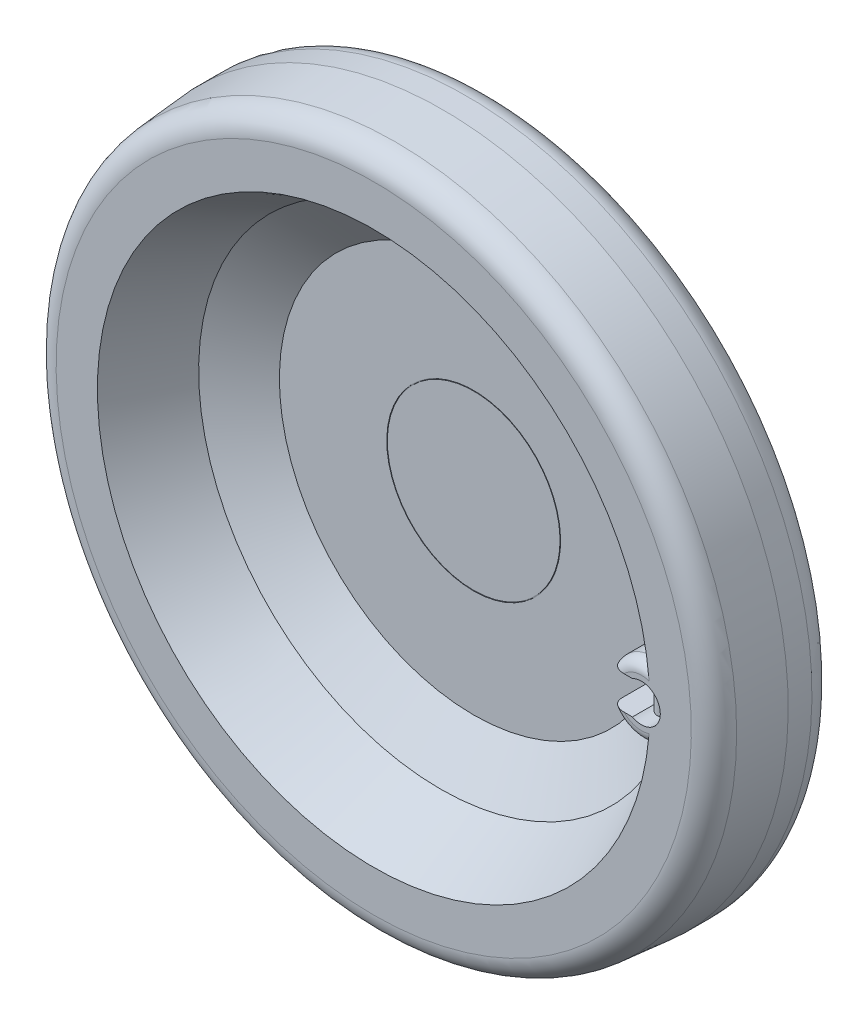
ISO-10303-21;
HEADER;
FILE_DESCRIPTION(('STEP AP214'),'2;1');
FILE_NAME('part.step','',(''),(''),'','','');
FILE_SCHEMA(('AUTOMOTIVE_DESIGN { 1 0 10303 214 1 1 1 1 }'));
ENDSEC;
DATA;
#1=APPLICATION_CONTEXT('core data for automotive mechanical design processes');
#2=APPLICATION_PROTOCOL_DEFINITION('international standard','automotive_design',2000,#1);
#3=PRODUCT_CONTEXT('',#1,'mechanical');
#4=PRODUCT('Part','Part','',(#3));
#5=PRODUCT_RELATED_PRODUCT_CATEGORY('part','',(#4));
#6=PRODUCT_DEFINITION_FORMATION('','',#4);
#7=PRODUCT_DEFINITION_CONTEXT('part definition',#1,'design');
#8=PRODUCT_DEFINITION('design','',#6,#7);
#9=PRODUCT_DEFINITION_SHAPE('','',#8);
#10=(LENGTH_UNIT() NAMED_UNIT(*) SI_UNIT(.MILLI.,.METRE.));
#11=(NAMED_UNIT(*) PLANE_ANGLE_UNIT() SI_UNIT($,.RADIAN.));
#12=(NAMED_UNIT(*) SI_UNIT($,.STERADIAN.) SOLID_ANGLE_UNIT());
#13=UNCERTAINTY_MEASURE_WITH_UNIT(LENGTH_MEASURE(1.E-05),#10,'distance_accuracy_value','');
#14=(GEOMETRIC_REPRESENTATION_CONTEXT(3) GLOBAL_UNCERTAINTY_ASSIGNED_CONTEXT((#13)) GLOBAL_UNIT_ASSIGNED_CONTEXT((#10,
#11,#12)) REPRESENTATION_CONTEXT('',''));
#15=CARTESIAN_POINT('',(0.,0.,0.));
#16=DIRECTION('',(0.,0.,1.));
#17=DIRECTION('',(1.,0.,0.));
#18=AXIS2_PLACEMENT_3D('',#15,#16,#17);
#19=CARTESIAN_POINT('',(0.,0.,64.));
#20=DIRECTION('',(0.,0.,1.));
#21=DIRECTION('',(0.,-1.,0.));
#22=AXIS2_PLACEMENT_3D('',#19,#20,#21);
#23=CONICAL_SURFACE('',#22,64.,0.477845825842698);
#24=CARTESIAN_POINT('',(61.0776545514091,-10.5002,60.0872021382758));
#25=CARTESIAN_POINT('',(61.0956063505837,-10.4297885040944,60.0983289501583));
#26=CARTESIAN_POINT('',(61.1130850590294,-10.3591479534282,60.1087262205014));
#27=CARTESIAN_POINT('',(61.1471855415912,-10.2174954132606,60.1282634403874));
#28=CARTESIAN_POINT('',(61.1638074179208,-10.1464834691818,60.1374035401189));
#29=CARTESIAN_POINT('',(61.2125129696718,-9.93306055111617,60.1632364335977));
#30=CARTESIAN_POINT('',(61.2434528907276,-9.79019766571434,60.1783516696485));
#31=CARTESIAN_POINT('',(61.3027235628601,-9.5038477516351,60.2054133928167));
#32=CARTESIAN_POINT('',(61.3310577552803,-9.36036181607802,60.217364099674));
#33=CARTESIAN_POINT('',(61.3854915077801,-9.07276916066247,60.2388171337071));
#34=CARTESIAN_POINT('',(61.4115907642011,-8.92866235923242,60.24831912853));
#35=CARTESIAN_POINT('',(61.4869780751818,-8.49522642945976,60.2739605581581));
#36=CARTESIAN_POINT('',(61.5332704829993,-8.20520180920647,60.2871991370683));
#37=CARTESIAN_POINT('',(61.597693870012,-7.76925465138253,60.3032661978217));
#38=CARTESIAN_POINT('',(61.6183366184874,-7.6237537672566,60.3079907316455));
#39=CARTESIAN_POINT('',(61.6580507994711,-7.33250232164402,60.3163843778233));
#40=CARTESIAN_POINT('',(61.6771221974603,-7.18675175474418,60.320053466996));
#41=CARTESIAN_POINT('',(61.7321922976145,-6.74866290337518,60.329787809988));
#42=CARTESIAN_POINT('',(61.7659696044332,-6.45601568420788,60.3345621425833));
#43=CARTESIAN_POINT('',(61.8281798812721,-5.87011901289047,60.3418217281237));
#44=CARTESIAN_POINT('',(61.8566125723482,-5.57686953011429,60.344306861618));
#45=CARTESIAN_POINT('',(61.9085441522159,-4.98987623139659,60.3477996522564));
#46=CARTESIAN_POINT('',(61.9320421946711,-4.69613233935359,60.3488070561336));
#47=CARTESIAN_POINT('',(61.9743978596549,-4.10830652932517,60.3499363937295));
#48=CARTESIAN_POINT('',(61.9932553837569,-3.8142246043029,60.3500583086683));
#49=CARTESIAN_POINT('',(62.0432401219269,-2.93122174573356,60.3497903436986));
#50=CARTESIAN_POINT('',(62.0677472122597,-2.34191607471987,60.3487657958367));
#51=CARTESIAN_POINT('',(62.1002124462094,-1.16292885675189,60.3471959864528));
#52=CARTESIAN_POINT('',(62.1081723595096,-0.573247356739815,60.3466506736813));
#53=CARTESIAN_POINT('',(62.1078700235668,0.606090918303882,60.3466693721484));
#54=CARTESIAN_POINT('',(62.0996083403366,1.1957476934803,60.3472333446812));
#55=CARTESIAN_POINT('',(62.066528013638,2.37467744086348,60.3488155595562));
#56=CARTESIAN_POINT('',(62.0417075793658,2.96395036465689,60.3498338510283));
#57=CARTESIAN_POINT('',(61.9912328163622,3.84689373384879,60.3500508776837));
#58=CARTESIAN_POINT('',(61.9722087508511,4.14095320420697,60.3499050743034));
#59=CARTESIAN_POINT('',(61.9295107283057,4.72873053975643,60.3487089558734));
#60=CARTESIAN_POINT('',(61.9058368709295,5.02244841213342,60.3476586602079));
#61=CARTESIAN_POINT('',(61.853541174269,5.60938422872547,60.3440544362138));
#62=CARTESIAN_POINT('',(61.8249201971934,5.90260225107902,60.3415007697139));
#63=CARTESIAN_POINT('',(61.7623161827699,6.48842932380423,60.3340690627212));
#64=CARTESIAN_POINT('',(61.7283334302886,6.78103840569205,60.329191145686));
#65=CARTESIAN_POINT('',(61.6731070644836,7.21771743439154,60.3192943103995));
#66=CARTESIAN_POINT('',(61.6541076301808,7.36210212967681,60.3155931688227));
#67=CARTESIAN_POINT('',(61.6145597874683,7.65062359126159,60.3071415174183));
#68=CARTESIAN_POINT('',(61.5940114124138,7.79476036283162,60.3023910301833));
#69=CARTESIAN_POINT('',(61.5299068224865,8.22662053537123,60.2862597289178));
#70=CARTESIAN_POINT('',(61.4838747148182,8.5139252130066,60.2729964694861));
#71=CARTESIAN_POINT('',(61.4089640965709,8.9433021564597,60.2473767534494));
#72=CARTESIAN_POINT('',(61.3830373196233,9.08606354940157,60.2378914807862));
#73=CARTESIAN_POINT('',(61.3289818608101,9.37097206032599,60.2165005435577));
#74=CARTESIAN_POINT('',(61.3008534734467,9.51311925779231,60.204595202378));
#75=CARTESIAN_POINT('',(61.2420347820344,9.79679779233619,60.1776662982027));
#76=CARTESIAN_POINT('',(61.2113411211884,9.93832805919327,60.162638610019));
#77=CARTESIAN_POINT('',(61.1630429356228,10.1497643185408,60.136985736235));
#78=CARTESIAN_POINT('',(61.1465632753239,10.2201156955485,60.1279138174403));
#79=CARTESIAN_POINT('',(61.1127621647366,10.3604530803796,60.1085342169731));
#80=CARTESIAN_POINT('',(61.0954406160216,10.4304390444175,60.0982263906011));
#81=CARTESIAN_POINT('',(61.077654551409,10.5002,60.0872021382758));
#82=B_SPLINE_CURVE_WITH_KNOTS('',3,(#24,#25,#26,#27,#28,#29,#30,#31,#32,#33,#34,#35,#36,#37,#38,
#39,#40,#41,#42,#43,#44,#45,#46,#47,#48,#49,#50,#51,#52,#53,#54,#55,#56,#57,#58,#59,#60,#61,#62,
#63,#64,#65,#66,#67,#68,#69,#70,#71,#72,#73,#74,#75,#76,#77,#78,#79,#80,#81),.UNSPECIFIED.,.F.,
.F.,(4,2,2,2,2,2,2,2,2,2,2,2,2,2,2,2,2,2,2,2,2,2,2,2,2,2,2,2,4),(0.,0.22051716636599,
0.441007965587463,0.881786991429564,1.32197526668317,1.76222325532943,2.64400864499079,
3.08510362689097,3.52620829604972,4.4100196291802,5.29387707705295,6.1778859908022,
7.06191365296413,8.83108973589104,10.6000765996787,12.3690017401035,14.1381182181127,
15.0221106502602,15.9060841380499,16.7899037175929,17.6736763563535,18.1106940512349,
18.5477023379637,19.4213216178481,19.8575116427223,20.293643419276,20.7303551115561,
20.9488097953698,21.1672900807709),.UNSPECIFIED.);
#83=CARTESIAN_POINT('',(61.4426453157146,-8.75,60.2588689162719));
#84=VERTEX_POINT('',#83);
#85=CARTESIAN_POINT('',(61.5502483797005,-8.0875041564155,60.2912166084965));
#86=VERTEX_POINT('',#85);
#87=EDGE_CURVE('E38',#84,#86,#82,.T.);
#88=ORIENTED_EDGE('',*,*,#87,.F.);
#89=CARTESIAN_POINT('',(64.5479558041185,-8.75,66.1980610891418));
#90=CARTESIAN_POINT('',(63.8601741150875,-8.75,64.8820175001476));
#91=CARTESIAN_POINT('',(63.1722380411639,-8.75,63.5660545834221));
#92=CARTESIAN_POINT('',(61.7960222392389,-8.75,60.9343085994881));
#93=CARTESIAN_POINT('',(61.1077425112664,-8.75,59.6185255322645));
#94=CARTESIAN_POINT('',(59.7308043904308,-8.75,56.9871575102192));
#95=CARTESIAN_POINT('',(59.0421459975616,-8.75,55.6715725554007));
#96=CARTESIAN_POINT('',(57.6644076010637,-8.75,53.0406232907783));
#97=CARTESIAN_POINT('',(56.9753275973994,-8.75,51.7252589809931));
#98=CARTESIAN_POINT('',(56.2860153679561,-8.75,50.4100163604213));
#99=B_SPLINE_CURVE_WITH_KNOTS('',3,(#89,#90,#91,#92,#93,#94,#95,#96,#97,#98),.UNSPECIFIED.,.F.,
.F.,(4,2,2,2,4),(0.,4.45478725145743,8.90957412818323,13.364361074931,17.8191483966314),.UNSPECIFIED.);
#100=CARTESIAN_POINT('',(60.3194140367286,-8.75,58.1120105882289));
#101=VERTEX_POINT('',#100);
#102=EDGE_CURVE('E9',#84,#101,#99,.T.);
#103=ORIENTED_EDGE('',*,*,#102,.T.);
#104=CARTESIAN_POINT('',(60.2520045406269,10.5002,58.5162601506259));
#105=CARTESIAN_POINT('',(60.2530335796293,10.4298581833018,58.4948978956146));
#106=CARTESIAN_POINT('',(60.2544048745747,10.3592842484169,58.4743391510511));
#107=CARTESIAN_POINT('',(60.2577144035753,10.2177593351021,58.4346428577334));
#108=CARTESIAN_POINT('',(60.259652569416,10.1468084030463,58.4155051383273));
#109=CARTESIAN_POINT('',(60.2661395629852,9.93356144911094,58.3599546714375));
#110=CARTESIAN_POINT('',(60.2713620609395,9.79080578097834,58.3253851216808));
#111=CARTESIAN_POINT('',(60.2829846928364,9.50465690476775,58.2602201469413));
#112=CARTESIAN_POINT('',(60.2893832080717,9.3612648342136,58.2296193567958));
#113=CARTESIAN_POINT('',(60.3029662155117,9.07384540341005,58.1716774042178));
#114=CARTESIAN_POINT('',(60.3101508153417,8.92981795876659,58.1443366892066));
#115=CARTESIAN_POINT('',(60.3324555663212,8.49658699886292,58.0663818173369));
#116=CARTESIAN_POINT('',(60.3483071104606,8.20666907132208,58.0199303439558));
#117=CARTESIAN_POINT('',(60.3724005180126,7.77085310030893,57.9566344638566));
#118=CARTESIAN_POINT('',(60.3804862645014,7.62539045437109,57.9365954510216));
#119=CARTESIAN_POINT('',(60.3966431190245,7.33420697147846,57.8984426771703));
#120=CARTESIAN_POINT('',(60.4047142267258,7.18848612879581,57.8803289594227));
#121=CARTESIAN_POINT('',(60.4287684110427,6.7503953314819,57.8285120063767));
#122=CARTESIAN_POINT('',(60.4445578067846,6.45770486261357,57.797419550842));
#123=CARTESIAN_POINT('',(60.4749657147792,5.8716971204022,57.7410498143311));
#124=CARTESIAN_POINT('',(60.4895841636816,5.57837981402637,57.7157728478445));
#125=CARTESIAN_POINT('',(60.5171900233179,4.99122956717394,57.6702204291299));
#126=CARTESIAN_POINT('',(60.5301771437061,4.69739654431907,57.6499458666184));
#127=CARTESIAN_POINT('',(60.5541806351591,4.10937696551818,57.6138069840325));
#128=CARTESIAN_POINT('',(60.5651969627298,3.81519040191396,57.5979427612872));
#129=CARTESIAN_POINT('',(60.5949087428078,2.93184031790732,57.5562437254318));
#130=CARTESIAN_POINT('',(60.6102480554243,2.34227361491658,57.5363312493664));
#131=CARTESIAN_POINT('',(60.6307491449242,1.16274424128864,57.5100836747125));
#132=CARTESIAN_POINT('',(60.635912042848,0.572781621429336,57.5037470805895));
#133=CARTESIAN_POINT('',(60.635708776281,-0.607117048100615,57.5040000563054));
#134=CARTESIAN_POINT('',(60.6303430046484,-1.19705309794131,57.5105891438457));
#135=CARTESIAN_POINT('',(60.6094515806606,-2.37652052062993,57.5373673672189));
#136=CARTESIAN_POINT('',(60.5939247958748,-2.96605184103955,57.5575580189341));
#137=CARTESIAN_POINT('',(60.5639570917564,-3.84933755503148,57.5997174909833));
#138=CARTESIAN_POINT('',(60.552859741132,-4.14349980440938,57.6157422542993));
#139=CARTESIAN_POINT('',(60.528705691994,-4.73146688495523,57.6522219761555));
#140=CARTESIAN_POINT('',(60.5156490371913,-5.02527172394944,57.672676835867));
#141=CARTESIAN_POINT('',(60.4879196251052,-5.61235972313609,57.7186163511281));
#142=CARTESIAN_POINT('',(60.473247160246,-5.90564296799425,57.7441000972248));
#143=CARTESIAN_POINT('',(60.4427523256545,-6.49157539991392,57.8009194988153));
#144=CARTESIAN_POINT('',(60.4269300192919,-6.78422462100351,57.8322548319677));
#145=CARTESIAN_POINT('',(60.4029264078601,-7.22084012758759,57.8843068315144));
#146=CARTESIAN_POINT('',(60.394928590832,-7.36513318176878,57.9023767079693));
#147=CARTESIAN_POINT('',(60.3789265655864,-7.65346302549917,57.9404183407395));
#148=CARTESIAN_POINT('',(60.3709223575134,-7.79749982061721,57.9603900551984));
#149=CARTESIAN_POINT('',(60.347083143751,-8.2290440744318,58.0234443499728));
#150=CARTESIAN_POINT('',(60.3314139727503,-8.51611935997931,58.0696816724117));
#151=CARTESIAN_POINT('',(60.3093827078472,-8.94510895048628,58.147204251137));
#152=CARTESIAN_POINT('',(60.3022890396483,-9.08773075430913,58.1743832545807));
#153=CARTESIAN_POINT('',(60.2888825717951,-9.37234609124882,58.2319554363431));
#154=CARTESIAN_POINT('',(60.2825696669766,-9.51433970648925,58.2623481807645));
#155=CARTESIAN_POINT('',(60.2711052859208,-9.79769820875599,58.3270367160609));
#156=CARTESIAN_POINT('',(60.2659553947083,-9.93906198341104,58.3613377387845));
#157=CARTESIAN_POINT('',(60.259557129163,-10.1502341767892,58.4164235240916));
#158=CARTESIAN_POINT('',(60.2576451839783,-10.220495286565,58.4353959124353));
#159=CARTESIAN_POINT('',(60.2543783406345,-10.3606469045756,58.4747360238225));
#160=CARTESIAN_POINT('',(60.2530235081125,-10.4305373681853,58.4951039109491));
#161=CARTESIAN_POINT('',(60.2520045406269,-10.5002,58.5162601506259));
#162=B_SPLINE_CURVE_WITH_KNOTS('',3,(#104,#105,#106,#107,#108,#109,#110,#111,#112,#113,#114,
#115,#116,#117,#118,#119,#120,#121,#122,#123,#124,#125,#126,#127,#128,#129,#130,#131,#132,#133,
#134,#135,#136,#137,#138,#139,#140,#141,#142,#143,#144,#145,#146,#147,#148,#149,#150,#151,#152,
#153,#154,#155,#156,#157,#158,#159,#160,#161),.UNSPECIFIED.,.F.,.F.,(4,2,2,2,2,2,2,2,2,2,2,2,2,
2,2,2,2,2,2,2,2,2,2,2,2,2,2,2,4),(0.,0.220548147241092,0.441069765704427,0.881908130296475,
1.32214419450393,1.76244060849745,2.6443674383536,3.08553733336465,3.52671714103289,
4.41092081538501,5.29517229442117,6.17958093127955,7.0640090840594,8.83403107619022,
10.6038580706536,12.3736190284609,14.143577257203,15.0279676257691,15.9123382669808,
16.7965491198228,17.6807112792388,18.1176189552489,18.554517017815,19.4279080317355,
19.863963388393,20.2999599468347,20.736547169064,20.9549406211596,21.1733597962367),.UNSPECIFIED.);
#163=CARTESIAN_POINT('',(60.3634398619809,-7.93294843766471,57.9801818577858));
#164=VERTEX_POINT('',#163);
#165=EDGE_CURVE('E117',#164,#101,#162,.T.);
#166=ORIENTED_EDGE('',*,*,#165,.F.);
#167=CARTESIAN_POINT('',(55.7611161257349,-5.1658811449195,48.552082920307));
#168=CARTESIAN_POINT('',(55.8211901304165,-5.23842574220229,48.6805129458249));
#169=CARTESIAN_POINT('',(55.8817689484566,-5.30901933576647,48.8097926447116));
#170=CARTESIAN_POINT('',(56.0038480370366,-5.44652454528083,49.0698477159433));
#171=CARTESIAN_POINT('',(56.0653482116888,-5.51343654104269,49.2006229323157));
#172=CARTESIAN_POINT('',(56.2510496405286,-5.70893069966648,49.5947828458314));
#173=CARTESIAN_POINT('',(56.3765176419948,-5.83234982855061,49.8601426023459));
#174=CARTESIAN_POINT('',(56.6300619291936,-6.06658741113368,50.3944006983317));
#175=CARTESIAN_POINT('',(56.7581329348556,-6.17742885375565,50.6632915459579));
#176=CARTESIAN_POINT('',(57.0167636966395,-6.38789092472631,51.2042916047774));
#177=CARTESIAN_POINT('',(57.1473238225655,-6.48750987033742,51.4764012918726));
#178=CARTESIAN_POINT('',(57.4089227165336,-6.67514658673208,52.0195992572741));
#179=CARTESIAN_POINT('',(57.5399333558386,-6.76329796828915,52.2906550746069));
#180=CARTESIAN_POINT('',(57.8038744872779,-6.93014343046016,52.8347441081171));
#181=CARTESIAN_POINT('',(57.9368051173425,-7.00883682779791,53.1077774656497));
#182=CARTESIAN_POINT('',(58.3383358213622,-7.23160361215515,53.9294916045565));
#183=CARTESIAN_POINT('',(58.6095664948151,-7.36228712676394,54.4805616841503));
#184=CARTESIAN_POINT('',(59.1460603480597,-7.58588921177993,55.5626515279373));
#185=CARTESIAN_POINT('',(59.4110772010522,-7.68019221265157,56.0935122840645));
#186=CARTESIAN_POINT('',(59.9456949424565,-7.84013107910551,57.1570454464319));
#187=CARTESIAN_POINT('',(60.2152945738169,-7.9057746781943,57.6897173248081));
#188=CARTESIAN_POINT('',(60.7619256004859,-8.00971507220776,58.7624037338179));
#189=CARTESIAN_POINT('',(61.0390077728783,-8.04765956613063,59.3024267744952));
#190=CARTESIAN_POINT('',(61.4572588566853,-8.08300652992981,60.1120567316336));
#191=CARTESIAN_POINT('',(61.5971320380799,-8.09119355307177,60.3819006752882));
#192=CARTESIAN_POINT('',(61.8776721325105,-8.10029091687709,60.9213000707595));
#193=CARTESIAN_POINT('',(62.0183390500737,-8.10120121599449,61.1908555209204));
#194=CARTESIAN_POINT('',(62.159366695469,-8.09843208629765,61.4602));
#195=B_SPLINE_CURVE_WITH_KNOTS('',3,(#167,#168,#169,#170,#171,#172,#173,#174,#175,#176,#177,
#178,#179,#180,#181,#182,#183,#184,#185,#186,#187,#188,#189,#190,#191,#192,#193,#194),
.UNSPECIFIED.,.F.,.F.,(4,2,2,2,2,2,2,2,2,2,2,2,2,4),(0.,0.477763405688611,0.955477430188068,
1.91038326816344,2.86351466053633,3.81678877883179,4.75770934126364,5.69869783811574,
7.58145631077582,9.38310196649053,11.184261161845,13.0079478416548,13.9200261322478,
14.8321096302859),.UNSPECIFIED.);
#196=CARTESIAN_POINT('',(55.7612096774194,-5.16599412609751,48.552282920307));
#197=VERTEX_POINT('',#196);
#198=EDGE_CURVE('E106',#197,#164,#195,.T.);
#199=ORIENTED_EDGE('',*,*,#198,.F.);
#200=CARTESIAN_POINT('',(0.,0.,48.552282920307));
#201=DIRECTION('',(0.,0.,1.));
#202=DIRECTION('',(0.,-1.,0.));
#203=AXIS2_PLACEMENT_3D('',#200,#201,#202);
#204=CIRCLE('',#203,56.);
#205=CARTESIAN_POINT('',(55.7612096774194,5.16599412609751,48.552282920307));
#206=VERTEX_POINT('',#205);
#207=EDGE_CURVE('E294',#206,#197,#204,.T.);
#208=ORIENTED_EDGE('',*,*,#207,.F.);
#209=CARTESIAN_POINT('',(62.159366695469,8.09843208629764,61.4602));
#210=CARTESIAN_POINT('',(62.0369292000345,8.10083800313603,61.2263601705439));
#211=CARTESIAN_POINT('',(61.9147628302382,8.10046824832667,60.9923600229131));
#212=CARTESIAN_POINT('',(61.6710213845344,8.09423536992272,60.524129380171));
#213=CARTESIAN_POINT('',(61.5494462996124,8.08837233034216,60.2898988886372));
#214=CARTESIAN_POINT('',(61.1856598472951,8.0626290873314,59.5869555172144));
#215=CARTESIAN_POINT('',(60.9444035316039,8.03459445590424,59.1180217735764));
#216=CARTESIAN_POINT('',(60.4636270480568,7.95670618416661,58.1779690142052));
#217=CARTESIAN_POINT('',(60.22412264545,7.90673876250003,57.7068514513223));
#218=CARTESIAN_POINT('',(59.7485645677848,7.78468410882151,56.7657550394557));
#219=CARTESIAN_POINT('',(59.5125107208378,7.71259798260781,56.2957761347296));
#220=CARTESIAN_POINT('',(59.0507095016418,7.54785651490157,55.370743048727));
#221=CARTESIAN_POINT('',(58.8248567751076,7.45581723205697,54.9156320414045));
#222=CARTESIAN_POINT('',(58.3773653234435,7.24895123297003,54.0085353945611));
#223=CARTESIAN_POINT('',(58.1557262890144,7.13412619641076,53.5565495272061));
#224=CARTESIAN_POINT('',(57.717764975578,6.88014709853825,52.6580949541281));
#225=CARTESIAN_POINT('',(57.5014324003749,6.74104524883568,52.2116165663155));
#226=CARTESIAN_POINT('',(57.0745305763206,6.43573455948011,51.3253211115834));
#227=CARTESIAN_POINT('',(56.8639589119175,6.26953729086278,50.8855012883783));
#228=CARTESIAN_POINT('',(56.5802498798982,6.02052058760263,50.2894378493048));
#229=CARTESIAN_POINT('',(56.504055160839,5.95108788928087,50.1290006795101));
#230=CARTESIAN_POINT('',(56.3527271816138,5.80768331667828,49.8096681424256));
#231=CARTESIAN_POINT('',(56.2775938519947,5.73371174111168,49.6507726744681));
#232=CARTESIAN_POINT('',(56.1281258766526,5.58055647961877,49.3339871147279));
#233=CARTESIAN_POINT('',(56.0537969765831,5.50134894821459,49.1761058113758));
#234=CARTESIAN_POINT('',(55.9064406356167,5.33766030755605,48.8624346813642));
#235=CARTESIAN_POINT('',(55.8334134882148,5.2531780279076,48.706645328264));
#236=CARTESIAN_POINT('',(55.7611161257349,5.1658811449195,48.552082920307));
#237=B_SPLINE_CURVE_WITH_KNOTS('',3,(#209,#210,#211,#212,#213,#214,#215,#216,#217,#218,#219,
#220,#221,#222,#223,#224,#225,#226,#227,#228,#229,#230,#231,#232,#233,#234,#235,#236),
.UNSPECIFIED.,.F.,.F.,(4,2,2,2,2,2,2,2,2,2,2,2,2,4),(0.,0.791864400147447,1.58371668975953,
3.16752628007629,4.75965118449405,6.35169650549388,7.90022740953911,9.44864420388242,
10.9937709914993,12.5382396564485,13.1102929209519,13.6823085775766,14.257137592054,
14.8320946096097),.UNSPECIFIED.);
#238=CARTESIAN_POINT('',(60.3634398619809,7.93294843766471,57.9801818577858));
#239=VERTEX_POINT('',#238);
#240=EDGE_CURVE('E282',#239,#206,#237,.T.);
#241=ORIENTED_EDGE('',*,*,#240,.F.);
#242=CARTESIAN_POINT('',(60.3194140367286,8.75,58.1120105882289));
#243=VERTEX_POINT('',#242);
#244=EDGE_CURVE('E122',#243,#239,#162,.T.);
#245=ORIENTED_EDGE('',*,*,#244,.F.);
#246=CARTESIAN_POINT('',(64.5479558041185,8.75,66.1980610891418));
#247=CARTESIAN_POINT('',(63.8601741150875,8.75,64.8820175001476));
#248=CARTESIAN_POINT('',(63.1722380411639,8.75,63.5660545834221));
#249=CARTESIAN_POINT('',(61.7960222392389,8.75,60.9343085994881));
#250=CARTESIAN_POINT('',(61.1077425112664,8.75,59.6185255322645));
#251=CARTESIAN_POINT('',(59.7308043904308,8.75,56.9871575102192));
#252=CARTESIAN_POINT('',(59.0421459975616,8.75,55.6715725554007));
#253=CARTESIAN_POINT('',(57.6644076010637,8.75,53.0406232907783));
#254=CARTESIAN_POINT('',(56.9753275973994,8.75,51.7252589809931));
#255=CARTESIAN_POINT('',(56.2860153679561,8.75,50.4100163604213));
#256=B_SPLINE_CURVE_WITH_KNOTS('',3,(#246,#247,#248,#249,#250,#251,#252,#253,#254,#255),
.UNSPECIFIED.,.F.,.F.,(4,2,2,2,4),(0.,4.45478725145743,8.90957412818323,13.364361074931,
17.8191483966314),.UNSPECIFIED.);
#257=CARTESIAN_POINT('',(61.4426453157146,8.75,60.2588689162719));
#258=VERTEX_POINT('',#257);
#259=EDGE_CURVE('E28',#258,#243,#256,.T.);
#260=ORIENTED_EDGE('',*,*,#259,.F.);
#261=CARTESIAN_POINT('',(61.5502483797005,8.0875041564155,60.2912166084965));
#262=VERTEX_POINT('',#261);
#263=EDGE_CURVE('E176',#262,#258,#82,.T.);
#264=ORIENTED_EDGE('',*,*,#263,.F.);
#265=CARTESIAN_POINT('',(62.1592619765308,8.09843414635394,61.4599999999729));
#266=VERTEX_POINT('',#265);
#267=EDGE_CURVE('E210',#266,#262,#237,.T.);
#268=ORIENTED_EDGE('',*,*,#267,.F.);
#269=CARTESIAN_POINT('',(62.6147185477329,2.95677546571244,61.4598));
#270=CARTESIAN_POINT('',(62.6394555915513,2.95163259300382,61.5070448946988));
#271=CARTESIAN_POINT('',(62.6641975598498,2.9475032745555,61.5543931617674));
#272=CARTESIAN_POINT('',(62.7136647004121,2.94137537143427,61.6492520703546));
#273=CARTESIAN_POINT('',(62.7383898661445,2.93937737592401,61.6967627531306));
#274=CARTESIAN_POINT('',(62.8127158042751,2.936730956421,61.8398873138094));
#275=CARTESIAN_POINT('',(62.8622297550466,2.93948140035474,61.935640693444));
#276=CARTESIAN_POINT('',(62.9612238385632,2.95534448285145,62.1280186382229));
#277=CARTESIAN_POINT('',(63.0106942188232,2.96859853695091,62.2246371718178));
#278=CARTESIAN_POINT('',(63.108089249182,3.00717575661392,62.4160182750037));
#279=CARTESIAN_POINT('',(63.1560171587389,3.03247140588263,62.5107845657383));
#280=CARTESIAN_POINT('',(63.2541201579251,3.09992375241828,62.7063032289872));
#281=CARTESIAN_POINT('',(63.3040393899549,3.14351567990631,62.8067042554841));
#282=CARTESIAN_POINT('',(63.3988795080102,3.24821913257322,62.9997917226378));
#283=CARTESIAN_POINT('',(63.4438260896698,3.3092341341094,63.0925171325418));
#284=CARTESIAN_POINT('',(63.5274320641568,3.44896194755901,63.2680696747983));
#285=CARTESIAN_POINT('',(63.5660467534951,3.52779197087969,63.3508254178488));
#286=CARTESIAN_POINT('',(63.6351109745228,3.70075643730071,63.5029212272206));
#287=CARTESIAN_POINT('',(63.6655480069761,3.79491395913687,63.572240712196));
#288=CARTESIAN_POINT('',(63.7156295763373,3.98844180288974,63.6915762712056));
#289=CARTESIAN_POINT('',(63.7358454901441,4.08707939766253,63.74255187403));
#290=CARTESIAN_POINT('',(63.7681236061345,4.29154027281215,63.8306336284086));
#291=CARTESIAN_POINT('',(63.780186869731,4.39736261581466,63.8677415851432));
#292=CARTESIAN_POINT('',(63.7969159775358,4.62157996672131,63.9304689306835));
#293=CARTESIAN_POINT('',(63.8009547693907,4.74032107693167,63.9550098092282));
#294=CARTESIAN_POINT('',(63.8002033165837,4.97992203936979,63.9887042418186));
#295=CARTESIAN_POINT('',(63.7954087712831,5.10078289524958,63.9978502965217));
#296=CARTESIAN_POINT('',(63.7763301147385,5.35840944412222,64.001719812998));
#297=CARTESIAN_POINT('',(63.7608518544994,5.49511870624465,63.9943286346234));
#298=CARTESIAN_POINT('',(63.720135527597,5.76491833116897,63.9618479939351));
#299=CARTESIAN_POINT('',(63.6948927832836,5.89800692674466,63.9367500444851));
#300=CARTESIAN_POINT('',(63.631978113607,6.17383785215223,63.8660109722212));
#301=CARTESIAN_POINT('',(63.593164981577,6.31577500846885,63.8182358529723));
#302=CARTESIAN_POINT('',(63.5058741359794,6.58861064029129,63.7037571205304));
#303=CARTESIAN_POINT('',(63.4573925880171,6.71950470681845,63.6370459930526));
#304=CARTESIAN_POINT('',(63.3478960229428,6.9777270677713,63.4803397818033));
#305=CARTESIAN_POINT('',(63.2861767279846,7.10386893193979,63.3888771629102));
#306=CARTESIAN_POINT('',(63.1551124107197,7.33686609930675,63.1884818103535));
#307=CARTESIAN_POINT('',(63.0857651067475,7.44371560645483,63.0795438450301));
#308=CARTESIAN_POINT('',(62.9387329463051,7.63911553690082,62.8424652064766));
#309=CARTESIAN_POINT('',(62.8608296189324,7.72680071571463,62.7137457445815));
#310=CARTESIAN_POINT('',(62.7014857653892,7.87581127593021,62.4438877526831));
#311=CARTESIAN_POINT('',(62.6200470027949,7.93714963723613,62.3027553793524));
#312=CARTESIAN_POINT('',(62.4747626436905,8.02073113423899,62.044912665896));
#313=CARTESIAN_POINT('',(62.4111111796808,8.04868312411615,61.9299131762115));
#314=CARTESIAN_POINT('',(62.2844049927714,8.08694176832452,61.6967584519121));
#315=CARTESIAN_POINT('',(62.2213500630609,8.09725477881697,61.5786043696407));
#316=CARTESIAN_POINT('',(62.1591572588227,8.0984361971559,61.4598));
#317=B_SPLINE_CURVE_WITH_KNOTS('',3,(#269,#270,#271,#272,#273,#274,#275,#276,#277,#278,#279,
#280,#281,#282,#283,#284,#285,#286,#287,#288,#289,#290,#291,#292,#293,#294,#295,#296,#297,#298,
#299,#300,#301,#302,#303,#304,#305,#306,#307,#308,#309,#310,#311,#312,#313,#314,#315,#316),
.UNSPECIFIED.,.F.,.F.,(4,2,2,2,2,2,2,2,2,2,2,2,2,2,2,2,2,2,2,2,2,2,2,4),(0.,0.160710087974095,
0.321464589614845,0.644510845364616,0.971981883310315,1.29870818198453,1.65816476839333,
2.01566736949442,2.37559436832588,2.73606841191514,3.07319271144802,3.41027311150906,
3.77279516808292,4.13549377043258,4.54717607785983,4.95905584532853,5.421221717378,
5.88357124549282,6.38408952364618,6.88475792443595,7.40474643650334,7.9244784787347,
8.32646448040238,8.72830559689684),.UNSPECIFIED.);
#318=CARTESIAN_POINT('',(63.7829548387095,5.26637181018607,64.));
#319=VERTEX_POINT('',#318);
#320=EDGE_CURVE('E193',#319,#266,#317,.T.);
#321=ORIENTED_EDGE('',*,*,#320,.F.);
#322=CARTESIAN_POINT('',(0.,0.,64.));
#323=DIRECTION('',(0.,0.,1.));
#324=DIRECTION('',(0.,-1.,0.));
#325=AXIS2_PLACEMENT_3D('',#322,#323,#324);
#326=CIRCLE('',#325,64.);
#327=CARTESIAN_POINT('',(63.7829548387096,-5.26637181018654,64.));
#328=VERTEX_POINT('',#327);
#329=EDGE_CURVE('E289',#319,#328,#326,.T.);
#330=ORIENTED_EDGE('',*,*,#329,.T.);
#331=CARTESIAN_POINT('',(62.1591572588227,-8.0984361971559,61.4598));
#332=CARTESIAN_POINT('',(62.1986660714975,-8.09767228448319,61.5352625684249));
#333=CARTESIAN_POINT('',(62.2385315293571,-8.09323554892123,61.6104886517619));
#334=CARTESIAN_POINT('',(62.3186616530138,-8.07715976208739,61.7599317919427));
#335=CARTESIAN_POINT('',(62.358926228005,-8.06552231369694,61.8341490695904));
#336=CARTESIAN_POINT('',(62.4394972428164,-8.03521095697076,61.9809612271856));
#337=CARTESIAN_POINT('',(62.4798035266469,-8.01654774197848,62.0535583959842));
#338=CARTESIAN_POINT('',(62.5602045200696,-7.9723882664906,62.196740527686));
#339=CARTESIAN_POINT('',(62.6002992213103,-7.94689173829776,62.2673254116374));
#340=CARTESIAN_POINT('',(62.7197858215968,-7.86048247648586,62.4753028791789));
#341=CARTESIAN_POINT('',(62.7984836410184,-7.78961073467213,62.6091063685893));
#342=CARTESIAN_POINT('',(62.9515012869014,-7.62354329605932,62.8633717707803));
#343=CARTESIAN_POINT('',(63.0258201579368,-7.52834231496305,62.9838307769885));
#344=CARTESIAN_POINT('',(63.1694305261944,-7.31385563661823,63.2108533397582));
#345=CARTESIAN_POINT('',(63.2385769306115,-7.19408970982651,63.3170563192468));
#346=CARTESIAN_POINT('',(63.3677039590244,-6.93502934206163,63.5093772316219));
#347=CARTESIAN_POINT('',(63.4276833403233,-6.79573225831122,63.5954924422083));
#348=CARTESIAN_POINT('',(63.5360602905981,-6.50194159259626,63.7445363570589));
#349=CARTESIAN_POINT('',(63.584506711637,-6.34751616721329,63.8075634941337));
#350=CARTESIAN_POINT('',(63.6680980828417,-6.02716423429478,63.9083470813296));
#351=CARTESIAN_POINT('',(63.7032442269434,-5.86123876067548,63.9461057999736));
#352=CARTESIAN_POINT('',(63.7569331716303,-5.53120766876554,63.9926734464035));
#353=CARTESIAN_POINT('',(63.7762047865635,-5.3674108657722,64.0028095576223));
#354=CARTESIAN_POINT('',(63.7993651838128,-5.03919976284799,63.9958598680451));
#355=CARTESIAN_POINT('',(63.803261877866,-4.8747858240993,63.9787880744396));
#356=CARTESIAN_POINT('',(63.7948182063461,-4.56923947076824,63.9190561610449));
#357=CARTESIAN_POINT('',(63.7841675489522,-4.42749596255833,63.8793236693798));
#358=CARTESIAN_POINT('',(63.7489757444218,-4.15481514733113,63.7761716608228));
#359=CARTESIAN_POINT('',(63.7244583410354,-4.02385980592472,63.7127926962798));
#360=CARTESIAN_POINT('',(63.666527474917,-3.79765822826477,63.5744313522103));
#361=CARTESIAN_POINT('',(63.635000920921,-3.70000231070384,63.5026171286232));
#362=CARTESIAN_POINT('',(63.5811609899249,-3.56589863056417,63.3841434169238));
#363=CARTESIAN_POINT('',(63.5621205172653,-3.52325726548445,63.3428556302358));
#364=CARTESIAN_POINT('',(63.522047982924,-3.44239311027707,63.2570474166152));
#365=CARTESIAN_POINT('',(63.5010159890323,-3.40417016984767,63.2125270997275));
#366=CARTESIAN_POINT('',(63.4395159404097,-3.30349942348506,63.0836386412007));
#367=CARTESIAN_POINT('',(63.3970317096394,-3.24632156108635,62.9960445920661));
#368=CARTESIAN_POINT('',(63.3078818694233,-3.14761767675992,62.8145126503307));
#369=CARTESIAN_POINT('',(63.2612132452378,-3.10610305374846,62.7205701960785));
#370=CARTESIAN_POINT('',(63.1433276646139,-3.02216429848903,62.485335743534));
#371=CARTESIAN_POINT('',(63.0705779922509,-2.98786978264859,62.3418953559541));
#372=CARTESIAN_POINT('',(62.9596926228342,-2.95571459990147,62.1250989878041));
#373=CARTESIAN_POINT('',(62.9223811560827,-2.94821387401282,62.0524528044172));
#374=CARTESIAN_POINT('',(62.8473930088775,-2.93900786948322,61.9069800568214));
#375=CARTESIAN_POINT('',(62.809716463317,-2.93730052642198,61.8341535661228));
#376=CARTESIAN_POINT('',(62.745741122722,-2.93887662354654,61.7108969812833));
#377=CARTESIAN_POINT('',(62.7194813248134,-2.94079522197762,61.6604189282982));
#378=CARTESIAN_POINT('',(62.6670514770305,-2.94703143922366,61.559855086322));
#379=CARTESIAN_POINT('',(62.6408815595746,-2.9513381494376,61.5097685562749));
#380=CARTESIAN_POINT('',(62.614718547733,-2.9567754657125,61.4598));
#381=B_SPLINE_CURVE_WITH_KNOTS('',3,(#331,#332,#333,#334,#335,#336,#337,#338,#339,#340,#341,
#342,#343,#344,#345,#346,#347,#348,#349,#350,#351,#352,#353,#354,#355,#356,#357,#358,#359,#360,
#361,#362,#363,#364,#365,#366,#367,#368,#369,#370,#371,#372,#373,#374,#375,#376,#377,#378,#379,
#380),.UNSPECIFIED.,.F.,.F.,(4,2,2,2,2,2,2,2,2,2,2,2,2,2,2,2,2,2,2,2,2,2,2,2,4),(0.,
0.255451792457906,0.510846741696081,0.765854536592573,1.02087232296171,1.53026130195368,
2.0397610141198,2.56037871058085,3.081066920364,3.59950867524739,4.11790387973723,
4.61091204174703,5.10366647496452,5.54379355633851,5.98316928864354,6.35661545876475,
6.54337445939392,6.73012710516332,7.06722333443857,7.40456441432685,7.89492720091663,
8.14083327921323,8.38665172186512,8.55740350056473,8.72738165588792),.UNSPECIFIED.);
#382=CARTESIAN_POINT('',(62.159261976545,-8.09843414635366,61.46));
#383=VERTEX_POINT('',#382);
#384=EDGE_CURVE('E202',#383,#328,#381,.T.);
#385=ORIENTED_EDGE('',*,*,#384,.F.);
#386=EDGE_CURVE('E115',#86,#383,#195,.T.);
#387=ORIENTED_EDGE('',*,*,#386,.F.);
#388=EDGE_LOOP('',(#88,#103,#166,#199,#208,#241,#245,#260,#264,#268,#321,#330,#385,#387));
#389=FACE_BOUND('',#388,.T.);
#390=ADVANCED_FACE('F14',(#389),#23,.F.);
#391=CARTESIAN_POINT('',(62.,0.,64.));
#392=DIRECTION('',(0.,0.,-1.));
#393=DIRECTION('',(0.,1.,0.));
#394=AXIS2_PLACEMENT_3D('',#391,#392,#393);
#395=CYLINDRICAL_SURFACE('',#394,8.1);
#396=CARTESIAN_POINT('',(62.,8.1,60.349997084));
#397=CARTESIAN_POINT('',(62.0970892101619,8.09999820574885,60.3499937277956));
#398=CARTESIAN_POINT('',(62.194219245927,8.09823662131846,60.3418901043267));
#399=CARTESIAN_POINT('',(62.3857223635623,8.09137942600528,60.3097221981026));
#400=CARTESIAN_POINT('',(62.4800933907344,8.08628139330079,60.2856463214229));
#401=CARTESIAN_POINT('',(62.6632830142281,8.07331917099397,60.2223216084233));
#402=CARTESIAN_POINT('',(62.7521072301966,8.06545783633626,60.1830884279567));
#403=CARTESIAN_POINT('',(62.9219088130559,8.04781837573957,60.0906120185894));
#404=CARTESIAN_POINT('',(63.0028864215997,8.03804030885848,60.0373692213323));
#405=CARTESIAN_POINT('',(63.1559692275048,8.01746789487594,59.917501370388));
#406=CARTESIAN_POINT('',(63.2279337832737,8.00666119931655,59.8506988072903));
#407=CARTESIAN_POINT('',(63.3597284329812,7.98533693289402,59.7059888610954));
#408=CARTESIAN_POINT('',(63.4195574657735,7.97481938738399,59.6280805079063));
#409=CARTESIAN_POINT('',(63.5260000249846,7.95514268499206,59.4623348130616));
#410=CARTESIAN_POINT('',(63.5724644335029,7.94599936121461,59.3743996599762));
#411=CARTESIAN_POINT('',(63.6499024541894,7.93028331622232,59.1917393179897));
#412=CARTESIAN_POINT('',(63.680877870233,7.92371029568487,59.0970149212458));
#413=CARTESIAN_POINT('',(63.7259950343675,7.91400472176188,58.904988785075));
#414=CARTESIAN_POINT('',(63.7403854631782,7.91082139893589,58.8077480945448));
#415=CARTESIAN_POINT('',(63.752697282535,7.90810312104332,58.6121845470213));
#416=CARTESIAN_POINT('',(63.7506206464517,7.9085677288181,58.5138618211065));
#417=CARTESIAN_POINT('',(63.7302575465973,7.91304682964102,58.3207695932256));
#418=CARTESIAN_POINT('',(63.7122594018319,7.91699817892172,58.2259679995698));
#419=CARTESIAN_POINT('',(63.6610207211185,7.9279057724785,58.0407624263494));
#420=CARTESIAN_POINT('',(63.6277793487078,7.93486218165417,57.9503586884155));
#421=CARTESIAN_POINT('',(63.5467315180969,7.95105865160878,57.7757015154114));
#422=CARTESIAN_POINT('',(63.4988136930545,7.96031606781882,57.6915014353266));
#423=CARTESIAN_POINT('',(63.389851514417,7.98006075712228,57.532230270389));
#424=CARTESIAN_POINT('',(63.3288054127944,7.99054819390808,57.457160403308));
#425=CARTESIAN_POINT('',(63.1937907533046,8.01184257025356,57.3166201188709));
#426=CARTESIAN_POINT('',(63.1195768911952,8.02265158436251,57.2513854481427));
#427=CARTESIAN_POINT('',(62.9611408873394,8.04316969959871,57.1342502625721));
#428=CARTESIAN_POINT('',(62.8769185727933,8.05287878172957,57.0823499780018));
#429=CARTESIAN_POINT('',(62.7005725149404,8.07013340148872,56.9933007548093));
#430=CARTESIAN_POINT('',(62.6084330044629,8.07767448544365,56.9561821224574));
#431=CARTESIAN_POINT('',(62.4190256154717,8.08971023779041,56.898019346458));
#432=CARTESIAN_POINT('',(62.3217584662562,8.09420533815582,56.8769729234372));
#433=CARTESIAN_POINT('',(62.126879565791,8.09958135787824,56.851893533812));
#434=CARTESIAN_POINT('',(62.0293111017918,8.1005306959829,56.8475384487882));
#435=CARTESIAN_POINT('',(61.8348407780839,8.09889970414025,56.8550931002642));
#436=CARTESIAN_POINT('',(61.7379388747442,8.09631960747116,56.8670017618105));
#437=CARTESIAN_POINT('',(61.5486154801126,8.08796277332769,56.9064786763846));
#438=CARTESIAN_POINT('',(61.456157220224,8.08222043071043,56.9338785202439));
#439=CARTESIAN_POINT('',(61.2771487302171,8.0681816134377,57.0033735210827));
#440=CARTESIAN_POINT('',(61.1905989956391,8.05988492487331,57.0454699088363));
#441=CARTESIAN_POINT('',(61.0245284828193,8.04148867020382,57.1438379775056));
#442=CARTESIAN_POINT('',(60.9451228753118,8.03136552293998,57.2002995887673));
#443=CARTESIAN_POINT('',(60.7967978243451,8.0104884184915,57.3255446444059));
#444=CARTESIAN_POINT('',(60.7278797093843,7.99973438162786,57.394329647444));
#445=CARTESIAN_POINT('',(60.6012169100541,7.97857206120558,57.5437454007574));
#446=CARTESIAN_POINT('',(60.5436950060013,7.96817344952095,57.6245666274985));
#447=CARTESIAN_POINT('',(60.4430403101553,7.94912016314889,57.7949119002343));
#448=CARTESIAN_POINT('',(60.3999069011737,7.94046541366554,57.8844355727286));
#449=CARTESIAN_POINT('',(60.3295412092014,7.92596109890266,58.0691675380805));
#450=CARTESIAN_POINT('',(60.3022203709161,7.92009594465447,58.1643408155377));
#451=CARTESIAN_POINT('',(60.2639944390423,7.91180600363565,58.3580699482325));
#452=CARTESIAN_POINT('',(60.2530867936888,7.90938068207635,58.4566252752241));
#453=CARTESIAN_POINT('',(60.2481034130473,7.90827812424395,58.6520761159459));
#454=CARTESIAN_POINT('',(60.2536746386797,7.90952227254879,58.7489623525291));
#455=CARTESIAN_POINT('',(60.280703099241,7.91544099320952,58.9403807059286));
#456=CARTESIAN_POINT('',(60.3021601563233,7.92011552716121,59.0349128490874));
#457=CARTESIAN_POINT('',(60.3601825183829,7.93233045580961,59.2186674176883));
#458=CARTESIAN_POINT('',(60.3966976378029,7.93986132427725,59.3079063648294));
#459=CARTESIAN_POINT('',(60.483756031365,7.9569443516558,59.4790442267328));
#460=CARTESIAN_POINT('',(60.5343007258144,7.96649671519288,59.5609423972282));
#461=CARTESIAN_POINT('',(60.6491596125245,7.98678210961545,59.7168168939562));
#462=CARTESIAN_POINT('',(60.7137259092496,7.99753472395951,59.7906049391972));
#463=CARTESIAN_POINT('',(60.8542828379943,8.01887618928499,59.9264149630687));
#464=CARTESIAN_POINT('',(60.9302761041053,8.0294650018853,59.9884342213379));
#465=CARTESIAN_POINT('',(61.0926823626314,8.04944378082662,60.0996922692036));
#466=CARTESIAN_POINT('',(61.1792144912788,8.05881697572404,60.1487603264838));
#467=CARTESIAN_POINT('',(61.3594811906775,8.07514068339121,60.2315781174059));
#468=CARTESIAN_POINT('',(61.4532095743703,8.08209324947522,60.265340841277));
#469=CARTESIAN_POINT('',(61.6225413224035,8.09153538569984,60.3104945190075));
#470=CARTESIAN_POINT('',(61.6972211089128,8.09469011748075,60.3252799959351));
#471=CARTESIAN_POINT('',(61.8479256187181,8.09892308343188,60.3450323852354));
#472=CARTESIAN_POINT('',(61.9239502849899,8.10000140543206,60.3499997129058));
#473=CARTESIAN_POINT('',(62.,8.1,60.349997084));
#474=B_SPLINE_CURVE_WITH_KNOTS('',3,(#396,#397,#398,#399,#400,#401,#402,#403,#404,#405,#406,
#407,#408,#409,#410,#411,#412,#413,#414,#415,#416,#417,#418,#419,#420,#421,#422,#423,#424,#425,
#426,#427,#428,#429,#430,#431,#432,#433,#434,#435,#436,#437,#438,#439,#440,#441,#442,#443,#444,
#445,#446,#447,#448,#449,#450,#451,#452,#453,#454,#455,#456,#457,#458,#459,#460,#461,#462,#463,
#464,#465,#466,#467,#468,#469,#470,#471,#472,#473),.UNSPECIFIED.,.T.,.F.,(4,2,2,2,2,2,2,2,2,2,2,
2,2,2,2,2,2,2,2,2,2,2,2,2,2,2,2,2,2,2,2,2,2,2,2,2,2,2,4),(0.,0.290989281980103,
0.582190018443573,0.87309077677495,1.16398257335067,1.45896137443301,1.75396595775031,
2.05214463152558,2.350288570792,2.64390136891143,2.93747898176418,3.22584666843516,
3.51423018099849,3.80485860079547,4.09552574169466,4.39232086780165,4.68912111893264,
4.98652679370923,5.28389028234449,5.57548531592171,5.86706107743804,6.15552635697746,
6.44401580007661,6.73653803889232,7.02909730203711,7.32690825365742,7.6247064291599,
7.92082028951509,8.21688810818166,8.5066593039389,8.79642725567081,9.08523717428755,
9.37407634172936,9.66861695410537,9.96322556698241,10.2615432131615,10.5596071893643,
10.7875479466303,11.0154790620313),.UNSPECIFIED.);
#475=EDGE_CURVE('E175',#239,#262,#474,.T.);
#476=ORIENTED_EDGE('',*,*,#475,.F.);
#477=ORIENTED_EDGE('',*,*,#240,.T.);
#478=CARTESIAN_POINT('',(55.7614676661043,5.16630567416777,48.552482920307));
#479=CARTESIAN_POINT('',(55.6397727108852,5.01936251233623,48.458144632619));
#480=CARTESIAN_POINT('',(55.5223073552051,4.86693909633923,48.366739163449));
#481=CARTESIAN_POINT('',(55.2967982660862,4.55134224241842,48.1906883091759));
#482=CARTESIAN_POINT('',(55.1887631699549,4.3881591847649,48.1060491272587));
#483=CARTESIAN_POINT('',(54.9825276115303,4.05025319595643,47.9439917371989));
#484=CARTESIAN_POINT('',(54.8844073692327,3.87545259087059,47.8666327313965));
#485=CARTESIAN_POINT('',(54.7001411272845,3.51608026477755,47.7209663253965));
#486=CARTESIAN_POINT('',(54.6139920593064,3.33151106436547,47.6526566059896));
#487=CARTESIAN_POINT('',(54.4543637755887,2.95227791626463,47.5257929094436));
#488=CARTESIAN_POINT('',(54.3809637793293,2.75755998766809,47.4673000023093));
#489=CARTESIAN_POINT('',(54.248682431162,2.36027396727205,47.3616871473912));
#490=CARTESIAN_POINT('',(54.1897986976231,2.15770716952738,47.3145653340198));
#491=CARTESIAN_POINT('',(54.0877979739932,1.74690985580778,47.2328260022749));
#492=CARTESIAN_POINT('',(54.0446286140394,1.53870068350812,47.1981669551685));
#493=CARTESIAN_POINT('',(53.9746668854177,1.11781652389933,47.1419490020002));
#494=CARTESIAN_POINT('',(53.9478718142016,0.905142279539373,47.1203879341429));
#495=CARTESIAN_POINT('',(53.9133641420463,0.502307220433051,47.0926116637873));
#496=CARTESIAN_POINT('',(53.9037942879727,0.312405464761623,47.0849030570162));
#497=CARTESIAN_POINT('',(53.8980536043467,-0.0677254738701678,47.0802794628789));
#498=CARTESIAN_POINT('',(53.9018817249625,-0.257954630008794,47.083363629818));
#499=CARTESIAN_POINT('',(53.9228709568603,-0.637240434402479,47.1002645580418));
#500=CARTESIAN_POINT('',(53.9400356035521,-0.826296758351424,47.1140841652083));
#501=CARTESIAN_POINT('',(53.987402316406,-1.20169441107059,47.1521830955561));
#502=CARTESIAN_POINT('',(54.0176042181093,-1.38803577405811,47.1764622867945));
#503=CARTESIAN_POINT('',(54.0883048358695,-1.74533372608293,47.2332205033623));
#504=CARTESIAN_POINT('',(54.1280592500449,-1.91653339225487,47.2651059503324));
#505=CARTESIAN_POINT('',(54.2180832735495,-2.25440728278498,47.3371954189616));
#506=CARTESIAN_POINT('',(54.2683564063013,-2.42107996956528,47.3774022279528));
#507=CARTESIAN_POINT('',(54.3788319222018,-2.74913992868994,47.4655892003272));
#508=CARTESIAN_POINT('',(54.4390420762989,-2.91052294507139,47.5135754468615));
#509=CARTESIAN_POINT('',(54.5686863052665,-3.22721212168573,47.616675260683));
#510=CARTESIAN_POINT('',(54.6381238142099,-3.38251599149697,47.6717914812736));
#511=CARTESIAN_POINT('',(54.8573807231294,-3.83458205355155,47.8454048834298));
#512=CARTESIAN_POINT('',(55.0196485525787,-4.12188014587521,47.9733718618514));
#513=CARTESIAN_POINT('',(55.2835507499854,-4.53051700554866,48.1802835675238));
#514=CARTESIAN_POINT('',(55.3747580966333,-4.6627995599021,48.2516103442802));
#515=CARTESIAN_POINT('',(55.5634947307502,-4.92003722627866,48.3987770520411));
#516=CARTESIAN_POINT('',(55.6610210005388,-5.04499578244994,48.4746148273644));
#517=CARTESIAN_POINT('',(55.7614676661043,-5.16630567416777,48.552482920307));
#518=B_SPLINE_CURVE_WITH_KNOTS('',3,(#478,#479,#480,#481,#482,#483,#484,#485,#486,#487,#488,
#489,#490,#491,#492,#493,#494,#495,#496,#497,#498,#499,#500,#501,#502,#503,#504,#505,#506,#507,
#508,#509,#510,#511,#512,#513,#514,#515,#516,#517),.UNSPECIFIED.,.F.,.F.,(4,2,2,2,2,2,2,2,2,2,2,
2,2,2,2,2,2,2,2,4),(0.,0.6384906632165,1.27756012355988,1.92144398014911,2.56516249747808,
3.21274797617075,3.86022713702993,4.50552830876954,5.15072294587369,5.72086218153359,
6.29095674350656,6.86120248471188,7.43144103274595,7.96673952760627,8.50221761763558,
9.03811646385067,9.57421531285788,10.6321795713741,11.1593264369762,11.686223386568),.UNSPECIFIED.);
#519=EDGE_CURVE('E111',#206,#197,#518,.T.);
#520=ORIENTED_EDGE('',*,*,#519,.T.);
#521=ORIENTED_EDGE('',*,*,#198,.T.);
#522=CARTESIAN_POINT('',(60.25,-7.90869774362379,58.599997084));
#523=CARTESIAN_POINT('',(60.250003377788,-7.90869970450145,58.5029376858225));
#524=CARTESIAN_POINT('',(60.2581021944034,-7.91050393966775,58.4058374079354));
#525=CARTESIAN_POINT('',(60.2902492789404,-7.91751306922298,58.2143960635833));
#526=CARTESIAN_POINT('',(60.3143092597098,-7.92272046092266,58.1200570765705));
#527=CARTESIAN_POINT('',(60.3775875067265,-7.93591923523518,57.9369353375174));
#528=CARTESIAN_POINT('',(60.4167893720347,-7.94390760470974,57.8481466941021));
#529=CARTESIAN_POINT('',(60.5091919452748,-7.96176462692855,57.6784051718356));
#530=CARTESIAN_POINT('',(60.5623922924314,-7.97163323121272,57.5974520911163));
#531=CARTESIAN_POINT('',(60.6822164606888,-7.99232052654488,57.4443435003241));
#532=CARTESIAN_POINT('',(60.7490273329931,-8.003151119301,57.3723359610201));
#533=CARTESIAN_POINT('',(60.8937721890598,-8.02443777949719,57.2404578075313));
#534=CARTESIAN_POINT('',(60.9717070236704,-8.03489381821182,57.1805881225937));
#535=CARTESIAN_POINT('',(61.1374778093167,-8.05438268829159,57.07410148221));
#536=CARTESIAN_POINT('',(61.2254070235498,-8.06339984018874,57.0276265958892));
#537=CARTESIAN_POINT('',(61.4080545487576,-8.07886061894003,56.9501675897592));
#538=CARTESIAN_POINT('',(61.5027721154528,-8.08530452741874,56.9191817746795));
#539=CARTESIAN_POINT('',(61.6947695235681,-8.09480866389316,56.87404517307));
#540=CARTESIAN_POINT('',(61.7919879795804,-8.0979191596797,56.859644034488));
#541=CARTESIAN_POINT('',(61.9875074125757,-8.10058008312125,56.8473030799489));
#542=CARTESIAN_POINT('',(62.0858082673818,-8.10013090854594,56.8493614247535));
#543=CARTESIAN_POINT('',(62.2789770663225,-8.09576159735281,56.8696940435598));
#544=CARTESIAN_POINT('',(62.3738749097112,-8.09189921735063,56.8876984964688));
#545=CARTESIAN_POINT('',(62.5592696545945,-8.08120318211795,56.9389825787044));
#546=CARTESIAN_POINT('',(62.6497663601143,-8.07436939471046,56.9722628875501));
#547=CARTESIAN_POINT('',(62.8245420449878,-8.05840517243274,57.0533943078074));
#548=CARTESIAN_POINT('',(62.9087717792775,-8.04925861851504,57.1013482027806));
#549=CARTESIAN_POINT('',(63.0680872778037,-8.0296725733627,57.2103890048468));
#550=CARTESIAN_POINT('',(63.1431718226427,-8.01923291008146,57.2714776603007));
#551=CARTESIAN_POINT('',(63.2836698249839,-7.99795916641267,57.406524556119));
#552=CARTESIAN_POINT('',(63.3488559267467,-7.98712138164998,57.4807189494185));
#553=CARTESIAN_POINT('',(63.4659021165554,-7.96647185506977,57.6390980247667));
#554=CARTESIAN_POINT('',(63.5177618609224,-7.95666013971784,57.7232829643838));
#555=CARTESIAN_POINT('',(63.6067808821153,-7.93916424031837,57.8996149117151));
#556=CARTESIAN_POINT('',(63.6438981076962,-7.93148616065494,57.9917837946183));
#557=CARTESIAN_POINT('',(63.702049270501,-7.91921212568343,58.1812555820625));
#558=CARTESIAN_POINT('',(63.7230856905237,-7.91461569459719,58.2785576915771));
#559=CARTESIAN_POINT('',(63.7481273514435,-7.90912217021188,58.4734589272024));
#560=CARTESIAN_POINT('',(63.7524632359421,-7.90815326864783,58.5710135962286));
#561=CARTESIAN_POINT('',(63.7448751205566,-7.90983094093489,58.7654518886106));
#562=CARTESIAN_POINT('',(63.7329522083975,-7.91247727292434,58.8623355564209));
#563=CARTESIAN_POINT('',(63.6934715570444,-7.9210195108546,59.0515363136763));
#564=CARTESIAN_POINT('',(63.6660951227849,-7.9268777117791,59.143893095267));
#565=CARTESIAN_POINT('',(63.596680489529,-7.94114974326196,59.3227088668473));
#566=CARTESIAN_POINT('',(63.5546409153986,-7.9495638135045,59.4091673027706));
#567=CARTESIAN_POINT('',(63.4563619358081,-7.96815782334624,59.5751653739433));
#568=CARTESIAN_POINT('',(63.3999183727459,-7.97836243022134,59.6545813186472));
#569=CARTESIAN_POINT('',(63.2747015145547,-7.99932227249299,59.8029354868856));
#570=CARTESIAN_POINT('',(63.2059267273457,-8.01007757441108,59.8718724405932));
#571=CARTESIAN_POINT('',(63.0565052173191,-8.03116312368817,59.9985907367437));
#572=CARTESIAN_POINT('',(62.9756656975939,-8.04148211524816,60.056146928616));
#573=CARTESIAN_POINT('',(62.8052732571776,-8.06032698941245,60.1568617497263));
#574=CARTESIAN_POINT('',(62.7157207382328,-8.06885295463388,60.2000210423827));
#575=CARTESIAN_POINT('',(62.5309951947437,-8.08310357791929,60.270401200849));
#576=CARTESIAN_POINT('',(62.4358615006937,-8.08884569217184,60.2977216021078));
#577=CARTESIAN_POINT('',(62.2422170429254,-8.09695702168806,60.3359600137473));
#578=CARTESIAN_POINT('',(62.1437067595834,-8.09932671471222,60.346880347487));
#579=CARTESIAN_POINT('',(61.9482447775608,-8.100412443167,60.3519063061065));
#580=CARTESIAN_POINT('',(61.8513019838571,-8.09920159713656,60.3463484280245));
#581=CARTESIAN_POINT('',(61.6597669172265,-8.09341852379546,60.3193269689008));
#582=CARTESIAN_POINT('',(61.5651746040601,-8.08884635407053,60.2978636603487));
#583=CARTESIAN_POINT('',(61.3812784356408,-8.07685928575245,60.2398001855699));
#584=CARTESIAN_POINT('',(61.291959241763,-8.06945315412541,60.2032466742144));
#585=CARTESIAN_POINT('',(61.1206765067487,-8.0525899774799,60.116086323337));
#586=CARTESIAN_POINT('',(61.0387136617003,-8.04313273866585,60.0654781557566));
#587=CARTESIAN_POINT('',(60.8828254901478,-8.02298075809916,59.9505422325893));
#588=CARTESIAN_POINT('',(60.809077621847,-8.01226630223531,59.8859772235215));
#589=CARTESIAN_POINT('',(60.6733480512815,-7.99091524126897,59.7454402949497));
#590=CARTESIAN_POINT('',(60.6113691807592,-7.98027865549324,59.6694656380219));
#591=CARTESIAN_POINT('',(60.5001637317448,-7.96013409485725,59.5070809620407));
#592=CARTESIAN_POINT('',(60.4511130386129,-7.95064255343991,59.4205483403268));
#593=CARTESIAN_POINT('',(60.3683278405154,-7.93406844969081,59.2402824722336));
#594=CARTESIAN_POINT('',(60.3345802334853,-7.92698382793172,59.1465554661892));
#595=CARTESIAN_POINT('',(60.2894617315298,-7.9173511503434,58.9772619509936));
#596=CARTESIAN_POINT('',(60.2746916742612,-7.91412744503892,58.9026211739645));
#597=CARTESIAN_POINT('',(60.2549597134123,-7.90980002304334,58.7519942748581));
#598=CARTESIAN_POINT('',(60.2499973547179,-7.90869620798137,58.6760082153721));
#599=CARTESIAN_POINT('',(60.25,-7.90869774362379,58.599997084));
#600=B_SPLINE_CURVE_WITH_KNOTS('',3,(#522,#523,#524,#525,#526,#527,#528,#529,#530,#531,#532,
#533,#534,#535,#536,#537,#538,#539,#540,#541,#542,#543,#544,#545,#546,#547,#548,#549,#550,#551,
#552,#553,#554,#555,#556,#557,#558,#559,#560,#561,#562,#563,#564,#565,#566,#567,#568,#569,#570,
#571,#572,#573,#574,#575,#576,#577,#578,#579,#580,#581,#582,#583,#584,#585,#586,#587,#588,#589,
#590,#591,#592,#593,#594,#595,#596,#597,#598,#599),.UNSPECIFIED.,.T.,.F.,(4,2,2,2,2,2,2,2,2,2,2,
2,2,2,2,2,2,2,2,2,2,2,2,2,2,2,2,2,2,2,2,2,2,2,2,2,2,2,4),(0.,0.290899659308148,
0.582013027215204,0.872811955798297,1.16360339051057,1.45869944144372,1.75381807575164,
2.0519604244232,2.3500701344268,2.64361821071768,2.9371334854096,3.22577515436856,
3.51442966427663,3.80515427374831,4.09591760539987,4.39258551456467,4.68926107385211,
4.98677688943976,5.28424676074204,5.57579599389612,5.86732572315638,6.15550418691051,
6.44370968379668,6.73625205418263,7.02882984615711,7.32671721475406,7.62459085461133,
7.92057170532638,8.21651062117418,8.50644814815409,8.79638070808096,9.08542350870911,
9.37449363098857,9.66893014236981,9.96343740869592,10.261765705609,10.5598380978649,
10.787663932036,11.0154791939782),.UNSPECIFIED.);
#601=EDGE_CURVE('E109',#86,#164,#600,.T.);
#602=ORIENTED_EDGE('',*,*,#601,.F.);
#603=ORIENTED_EDGE('',*,*,#386,.T.);
#604=CARTESIAN_POINT('',(62.,0.,61.46));
#605=DIRECTION('',(0.,0.,-1.));
#606=DIRECTION('',(0.,1.,0.));
#607=AXIS2_PLACEMENT_3D('',#604,#605,#606);
#608=CIRCLE('',#607,8.1);
#609=CARTESIAN_POINT('',(54.8734650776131,-3.85,61.46));
#610=VERTEX_POINT('',#609);
#611=EDGE_CURVE('E274',#383,#610,#608,.T.);
#612=ORIENTED_EDGE('',*,*,#611,.T.);
#613=DIRECTION('',(0.,0.,-1.));
#614=VECTOR('',#613,1.);
#615=CARTESIAN_POINT('',(54.8734650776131,-3.85,64.));
#616=LINE('',#615,#614);
#617=CARTESIAN_POINT('',(54.8734650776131,-3.85,52.33333345));
#618=VERTEX_POINT('',#617);
#619=EDGE_CURVE('E261',#610,#618,#616,.T.);
#620=ORIENTED_EDGE('',*,*,#619,.T.);
#621=CARTESIAN_POINT('',(62.,0.,52.33333345));
#622=DIRECTION('',(0.,0.,1.));
#623=DIRECTION('',(0.,-1.,0.));
#624=AXIS2_PLACEMENT_3D('',#621,#622,#623);
#625=CIRCLE('',#624,8.1);
#626=CARTESIAN_POINT('',(54.8734650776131,3.85,52.33333345));
#627=VERTEX_POINT('',#626);
#628=EDGE_CURVE('E582',#627,#618,#625,.T.);
#629=ORIENTED_EDGE('',*,*,#628,.F.);
#630=DIRECTION('',(0.,0.,-1.));
#631=VECTOR('',#630,1.);
#632=CARTESIAN_POINT('',(54.8734650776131,3.85,64.));
#633=LINE('',#632,#631);
#634=CARTESIAN_POINT('',(54.8734650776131,3.85,61.46));
#635=VERTEX_POINT('',#634);
#636=EDGE_CURVE('E267',#627,#635,#633,.F.);
#637=ORIENTED_EDGE('',*,*,#636,.T.);
#638=EDGE_CURVE('E273',#635,#266,#608,.T.);
#639=ORIENTED_EDGE('',*,*,#638,.T.);
#640=ORIENTED_EDGE('',*,*,#267,.T.);
#641=EDGE_LOOP('',(#476,#477,#520,#521,#602,#603,#612,#620,#629,#637,#639,#640));
#642=FACE_BOUND('',#641,.T.);
#643=ADVANCED_FACE('F107',(#642),#395,.T.);
#644=CARTESIAN_POINT('',(62.,0.,52.33333345));
#645=DIRECTION('',(0.,0.,1.));
#646=DIRECTION('',(0.,-1.,0.));
#647=AXIS2_PLACEMENT_3D('',#644,#645,#646);
#648=CYLINDRICAL_SURFACE('',#647,4.37500000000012);
#649=CARTESIAN_POINT('',(60.25,4.00975373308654,58.599997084));
#650=CARTESIAN_POINT('',(60.2500102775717,4.00976320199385,58.5062500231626));
#651=CARTESIAN_POINT('',(60.25757765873,4.01308777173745,58.4123703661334));
#652=CARTESIAN_POINT('',(60.2875645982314,4.02597049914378,58.2273041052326));
#653=CARTESIAN_POINT('',(60.3100221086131,4.03554458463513,58.1361250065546));
#654=CARTESIAN_POINT('',(60.3687943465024,4.05965398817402,57.9594507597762));
#655=CARTESIAN_POINT('',(60.4050568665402,4.07417059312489,57.8739356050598));
#656=CARTESIAN_POINT('',(60.4902572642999,4.10650331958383,57.7102226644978));
#657=CARTESIAN_POINT('',(60.539192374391,4.12431872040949,57.632023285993));
#658=CARTESIAN_POINT('',(60.6513432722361,4.16238256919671,57.4806442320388));
#659=CARTESIAN_POINT('',(60.7151680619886,4.18270928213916,57.4079352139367));
#660=CARTESIAN_POINT('',(60.8540045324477,4.22285899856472,57.273909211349));
#661=CARTESIAN_POINT('',(60.9290201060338,4.2426818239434,57.2125962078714));
#662=CARTESIAN_POINT('',(61.0917444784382,4.28052981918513,57.1007664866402));
#663=CARTESIAN_POINT('',(61.1798371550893,4.29845328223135,57.0507708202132));
#664=CARTESIAN_POINT('',(61.3640278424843,4.32953436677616,56.9665089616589));
#665=CARTESIAN_POINT('',(61.4601225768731,4.34269392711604,56.9322363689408));
#666=CARTESIAN_POINT('',(61.652654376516,4.36221034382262,56.8820732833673));
#667=CARTESIAN_POINT('',(61.748849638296,4.36886569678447,56.8653731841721));
#668=CARTESIAN_POINT('',(61.9428919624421,4.3757027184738,56.8482221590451));
#669=CARTESIAN_POINT('',(62.0407383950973,4.3758868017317,56.847765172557));
#670=CARTESIAN_POINT('',(62.2294534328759,4.36994217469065,56.8626695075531));
#671=CARTESIAN_POINT('',(62.3204052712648,4.36416747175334,56.8771437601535));
#672=CARTESIAN_POINT('',(62.4984639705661,4.34743130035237,56.919990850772));
#673=CARTESIAN_POINT('',(62.5855705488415,4.3364694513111,56.9483647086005));
#674=CARTESIAN_POINT('',(62.7550356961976,4.31022221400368,57.0185540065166));
#675=CARTESIAN_POINT('',(62.8373029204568,4.29487415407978,57.060565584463));
#676=CARTESIAN_POINT('',(62.9938321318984,4.26137762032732,57.1566539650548));
#677=CARTESIAN_POINT('',(63.0680913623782,4.24322818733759,57.2107349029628));
#678=CARTESIAN_POINT('',(63.2116727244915,4.20456432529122,57.3335650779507));
#679=CARTESIAN_POINT('',(63.2803506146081,4.18397285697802,57.4030442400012));
#680=CARTESIAN_POINT('',(63.4053439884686,4.14366453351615,57.5526138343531));
#681=CARTESIAN_POINT('',(63.4616554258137,4.12394796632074,57.6327077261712));
#682=CARTESIAN_POINT('',(63.5617911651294,4.08709785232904,57.8041137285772));
#683=CARTESIAN_POINT('',(63.6052178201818,4.07005299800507,57.8956788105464));
#684=CARTESIAN_POINT('',(63.6757792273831,4.04151641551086,58.0856856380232));
#685=CARTESIAN_POINT('',(63.7029245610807,4.03002108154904,58.1841228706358));
#686=CARTESIAN_POINT('',(63.738585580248,4.01476039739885,58.378653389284));
#687=CARTESIAN_POINT('',(63.7481380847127,4.01056570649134,58.4745224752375));
#688=CARTESIAN_POINT('',(63.7513661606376,4.00915810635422,58.6665646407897));
#689=CARTESIAN_POINT('',(63.7450465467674,4.01194307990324,58.7627376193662));
#690=CARTESIAN_POINT('',(63.7176537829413,4.02374038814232,58.9468986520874));
#691=CARTESIAN_POINT('',(63.6974414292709,4.03238900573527,59.0350409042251));
#692=CARTESIAN_POINT('',(63.643953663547,4.05448794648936,59.2066244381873));
#693=CARTESIAN_POINT('',(63.6106753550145,4.06793933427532,59.2900646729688));
#694=CARTESIAN_POINT('',(63.5304936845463,4.09879559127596,59.4536491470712));
#695=CARTESIAN_POINT('',(63.4830925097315,4.11633866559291,59.5335224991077));
#696=CARTESIAN_POINT('',(63.3765195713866,4.15319087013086,59.6845446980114));
#697=CARTESIAN_POINT('',(63.3173430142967,4.17250071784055,59.7556899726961));
#698=CARTESIAN_POINT('',(63.1837386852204,4.21243301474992,59.8926988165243));
#699=CARTESIAN_POINT('',(63.1085072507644,4.23304706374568,59.9577840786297));
#700=CARTESIAN_POINT('',(62.9476981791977,4.27192320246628,60.0745270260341));
#701=CARTESIAN_POINT('',(62.8621201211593,4.29018519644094,60.1261841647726));
#702=CARTESIAN_POINT('',(62.6827449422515,4.3223575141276,60.2144137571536));
#703=CARTESIAN_POINT('',(62.5889497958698,4.33626887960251,60.2509898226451));
#704=CARTESIAN_POINT('',(62.3958443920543,4.35813624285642,60.3076023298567));
#705=CARTESIAN_POINT('',(62.2965371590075,4.36609547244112,60.3276477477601));
#706=CARTESIAN_POINT('',(62.102214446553,4.37481632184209,60.3495636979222));
#707=CARTESIAN_POINT('',(62.0073416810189,4.37601365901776,60.3525346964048));
#708=CARTESIAN_POINT('',(61.8184953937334,4.37225287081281,60.3431235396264));
#709=CARTESIAN_POINT('',(61.7245217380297,4.36729567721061,60.3307437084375));
#710=CARTESIAN_POINT('',(61.5431004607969,4.35200074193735,60.2917686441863));
#711=CARTESIAN_POINT('',(61.4555410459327,4.34183295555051,60.2656217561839));
#712=CARTESIAN_POINT('',(61.2860679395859,4.31720579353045,60.2003258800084));
#713=CARTESIAN_POINT('',(61.2041552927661,4.30274562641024,60.1611744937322));
#714=CARTESIAN_POINT('',(61.0443223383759,4.27015832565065,60.0690317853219));
#715=CARTESIAN_POINT('',(60.9667384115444,4.25189738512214,60.0155053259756));
#716=CARTESIAN_POINT('',(60.8213277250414,4.21390727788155,59.8969321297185));
#717=CARTESIAN_POINT('',(60.7535050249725,4.19417750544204,59.8318806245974));
#718=CARTESIAN_POINT('',(60.6251988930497,4.1539554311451,59.6873462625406));
#719=CARTESIAN_POINT('',(60.5654297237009,4.13349153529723,59.607219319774));
#720=CARTESIAN_POINT('',(60.4601334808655,4.09543462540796,59.4374227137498));
#721=CARTESIAN_POINT('',(60.4146080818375,4.07784194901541,59.3477519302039));
#722=CARTESIAN_POINT('',(60.3427577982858,4.04914006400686,59.1695895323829));
#723=CARTESIAN_POINT('',(60.3150759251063,4.03759053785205,59.0817150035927));
#724=CARTESIAN_POINT('',(60.2738719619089,4.02015253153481,58.9023223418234));
#725=CARTESIAN_POINT('',(60.260310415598,4.0142482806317,58.8108151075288));
#726=CARTESIAN_POINT('',(60.2513437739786,4.01033901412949,58.6792917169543));
#727=CARTESIAN_POINT('',(60.2499956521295,4.00974972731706,58.6396562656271));
#728=CARTESIAN_POINT('',(60.25,4.00975373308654,58.599997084));
#729=B_SPLINE_CURVE_WITH_KNOTS('',3,(#649,#650,#651,#652,#653,#654,#655,#656,#657,#658,#659,
#660,#661,#662,#663,#664,#665,#666,#667,#668,#669,#670,#671,#672,#673,#674,#675,#676,#677,#678,
#679,#680,#681,#682,#683,#684,#685,#686,#687,#688,#689,#690,#691,#692,#693,#694,#695,#696,#697,
#698,#699,#700,#701,#702,#703,#704,#705,#706,#707,#708,#709,#710,#711,#712,#713,#714,#715,#716,
#717,#718,#719,#720,#721,#722,#723,#724,#725,#726,#727,#728),.UNSPECIFIED.,.T.,.F.,(4,2,2,2,2,2,
2,2,2,2,2,2,2,2,2,2,2,2,2,2,2,2,2,2,2,2,2,2,2,2,2,2,2,2,2,2,2,2,2,4),(0.,0.281117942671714,
0.562955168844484,0.843736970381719,1.12445750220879,1.41973665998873,1.71511877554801,
2.02214835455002,2.32905283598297,2.62109910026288,2.91303639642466,3.18857564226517,
3.46413510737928,3.74384762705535,4.02365613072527,4.32183538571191,4.62011206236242,
4.92681401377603,5.2333164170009,5.52109379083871,5.80878388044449,6.08008842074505,
6.35145313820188,6.63382260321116,6.91630725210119,7.21965767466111,7.52302044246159,
7.82631051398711,8.12943578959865,8.41278409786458,8.69608951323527,8.97069245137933,
9.24534605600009,9.5321366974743,9.81904626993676,10.1237172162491,10.4284239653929,
10.705770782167,10.9823405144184,11.1012659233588),.UNSPECIFIED.);
#730=CARTESIAN_POINT('',(60.25,4.00975373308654,58.599997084));
#731=VERTEX_POINT('',#730);
#732=EDGE_CURVE('E157',#731,#731,#729,.T.);
#733=ORIENTED_EDGE('',*,*,#732,.F.);
#734=EDGE_LOOP('',(#733));
#735=FACE_BOUND('',#734,.T.);
#736=CARTESIAN_POINT('',(62.,0.,64.));
#737=DIRECTION('',(0.,0.,1.));
#738=DIRECTION('',(0.,-1.,0.));
#739=AXIS2_PLACEMENT_3D('',#736,#737,#738);
#740=CIRCLE('',#739,4.37500000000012);
#741=CARTESIAN_POINT('',(59.921990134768,-3.85,64.));
#742=VERTEX_POINT('',#741);
#743=CARTESIAN_POINT('',(59.921990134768,3.85,64.));
#744=VERTEX_POINT('',#743);
#745=EDGE_CURVE('E250',#742,#744,#740,.T.);
#746=ORIENTED_EDGE('',*,*,#745,.T.);
#747=DIRECTION('',(0.,0.,1.));
#748=VECTOR('',#747,1.);
#749=CARTESIAN_POINT('',(59.921990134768,3.85,52.33333345));
#750=LINE('',#749,#748);
#751=CARTESIAN_POINT('',(59.921990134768,3.85,52.33333345));
#752=VERTEX_POINT('',#751);
#753=EDGE_CURVE('E259',#752,#744,#750,.T.);
#754=ORIENTED_EDGE('',*,*,#753,.F.);
#755=CARTESIAN_POINT('',(62.,0.,52.33333345));
#756=DIRECTION('',(0.,0.,1.));
#757=DIRECTION('',(0.,-1.,0.));
#758=AXIS2_PLACEMENT_3D('',#755,#756,#757);
#759=CIRCLE('',#758,4.37500000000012);
#760=CARTESIAN_POINT('',(59.921990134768,-3.85,52.33333345));
#761=VERTEX_POINT('',#760);
#762=EDGE_CURVE('E253',#761,#752,#759,.T.);
#763=ORIENTED_EDGE('',*,*,#762,.F.);
#764=DIRECTION('',(0.,0.,1.));
#765=VECTOR('',#764,1.);
#766=CARTESIAN_POINT('',(59.921990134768,-3.85,52.33333345));
#767=LINE('',#766,#765);
#768=EDGE_CURVE('E262',#761,#742,#767,.T.);
#769=ORIENTED_EDGE('',*,*,#768,.T.);
#770=EDGE_LOOP('',(#746,#754,#763,#769));
#771=FACE_BOUND('',#770,.T.);
#772=CARTESIAN_POINT('',(60.25,-4.00975373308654,58.599997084));
#773=CARTESIAN_POINT('',(60.2500102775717,-4.00976320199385,58.6937441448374));
#774=CARTESIAN_POINT('',(60.25757765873,-4.01308777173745,58.7876238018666));
#775=CARTESIAN_POINT('',(60.2875645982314,-4.02597049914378,58.9726900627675));
#776=CARTESIAN_POINT('',(60.3100221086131,-4.03554458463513,59.0638691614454));
#777=CARTESIAN_POINT('',(60.3687943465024,-4.05965398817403,59.2405434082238));
#778=CARTESIAN_POINT('',(60.4050568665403,-4.0741705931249,59.3260585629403));
#779=CARTESIAN_POINT('',(60.4902572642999,-4.10650331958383,59.4897715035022));
#780=CARTESIAN_POINT('',(60.539192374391,-4.12431872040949,59.5679708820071));
#781=CARTESIAN_POINT('',(60.6513432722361,-4.16238256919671,59.7193499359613));
#782=CARTESIAN_POINT('',(60.7151680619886,-4.18270928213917,59.7920589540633));
#783=CARTESIAN_POINT('',(60.8540045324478,-4.22285899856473,59.926084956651));
#784=CARTESIAN_POINT('',(60.9290201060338,-4.24268182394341,59.9873979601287));
#785=CARTESIAN_POINT('',(61.0917444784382,-4.28052981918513,60.0992276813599));
#786=CARTESIAN_POINT('',(61.1798371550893,-4.29845328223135,60.1492233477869));
#787=CARTESIAN_POINT('',(61.3640278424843,-4.32953436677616,60.2334852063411));
#788=CARTESIAN_POINT('',(61.4601225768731,-4.34269392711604,60.2677577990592));
#789=CARTESIAN_POINT('',(61.652654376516,-4.36221034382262,60.3179208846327));
#790=CARTESIAN_POINT('',(61.748849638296,-4.36886569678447,60.3346209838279));
#791=CARTESIAN_POINT('',(61.9428919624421,-4.3757027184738,60.3517720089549));
#792=CARTESIAN_POINT('',(62.0407383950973,-4.3758868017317,60.352228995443));
#793=CARTESIAN_POINT('',(62.2294534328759,-4.36994217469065,60.3373246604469));
#794=CARTESIAN_POINT('',(62.3204052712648,-4.36416747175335,60.3228504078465));
#795=CARTESIAN_POINT('',(62.4984639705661,-4.34743130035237,60.280003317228));
#796=CARTESIAN_POINT('',(62.5855705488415,-4.3364694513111,60.2516294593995));
#797=CARTESIAN_POINT('',(62.7550356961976,-4.31022221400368,60.1814401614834));
#798=CARTESIAN_POINT('',(62.8373029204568,-4.29487415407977,60.139428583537));
#799=CARTESIAN_POINT('',(62.9938321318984,-4.26137762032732,60.0433402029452));
#800=CARTESIAN_POINT('',(63.0680913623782,-4.24322818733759,59.9892592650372));
#801=CARTESIAN_POINT('',(63.2116727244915,-4.20456432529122,59.8664290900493));
#802=CARTESIAN_POINT('',(63.2803506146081,-4.18397285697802,59.7969499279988));
#803=CARTESIAN_POINT('',(63.4053439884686,-4.14366453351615,59.6473803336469));
#804=CARTESIAN_POINT('',(63.4616554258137,-4.12394796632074,59.5672864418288));
#805=CARTESIAN_POINT('',(63.5617911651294,-4.08709785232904,59.3958804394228));
#806=CARTESIAN_POINT('',(63.6052178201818,-4.07005299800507,59.3043153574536));
#807=CARTESIAN_POINT('',(63.6757792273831,-4.04151641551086,59.1143085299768));
#808=CARTESIAN_POINT('',(63.7029245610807,-4.03002108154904,59.0158712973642));
#809=CARTESIAN_POINT('',(63.738585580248,-4.01476039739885,58.8213407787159));
#810=CARTESIAN_POINT('',(63.7481380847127,-4.01056570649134,58.7254716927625));
#811=CARTESIAN_POINT('',(63.7513661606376,-4.00915810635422,58.5334295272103));
#812=CARTESIAN_POINT('',(63.7450465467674,-4.01194307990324,58.4372565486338));
#813=CARTESIAN_POINT('',(63.7176537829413,-4.02374038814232,58.2530955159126));
#814=CARTESIAN_POINT('',(63.6974414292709,-4.03238900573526,58.1649532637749));
#815=CARTESIAN_POINT('',(63.643953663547,-4.05448794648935,57.9933697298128));
#816=CARTESIAN_POINT('',(63.6106753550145,-4.06793933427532,57.9099294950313));
#817=CARTESIAN_POINT('',(63.5304936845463,-4.09879559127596,57.7463450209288));
#818=CARTESIAN_POINT('',(63.4830925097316,-4.11633866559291,57.6664716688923));
#819=CARTESIAN_POINT('',(63.3765195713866,-4.15319087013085,57.5154494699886));
#820=CARTESIAN_POINT('',(63.3173430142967,-4.17250071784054,57.4443041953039));
#821=CARTESIAN_POINT('',(63.1837386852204,-4.21243301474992,57.3072953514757));
#822=CARTESIAN_POINT('',(63.1085072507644,-4.23304706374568,57.2422100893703));
#823=CARTESIAN_POINT('',(62.9476981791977,-4.27192320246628,57.1254671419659));
#824=CARTESIAN_POINT('',(62.8621201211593,-4.29018519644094,57.0738100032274));
#825=CARTESIAN_POINT('',(62.6827449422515,-4.3223575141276,56.9855804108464));
#826=CARTESIAN_POINT('',(62.5889497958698,-4.33626887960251,56.9490043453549));
#827=CARTESIAN_POINT('',(62.3958443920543,-4.35813624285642,56.8923918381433));
#828=CARTESIAN_POINT('',(62.2965371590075,-4.36609547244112,56.8723464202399));
#829=CARTESIAN_POINT('',(62.102214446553,-4.37481632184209,56.8504304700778));
#830=CARTESIAN_POINT('',(62.0073416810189,-4.37601365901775,56.8474594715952));
#831=CARTESIAN_POINT('',(61.8184953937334,-4.37225287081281,56.8568706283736));
#832=CARTESIAN_POINT('',(61.7245217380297,-4.36729567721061,56.8692504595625));
#833=CARTESIAN_POINT('',(61.5431004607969,-4.35200074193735,56.9082255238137));
#834=CARTESIAN_POINT('',(61.4555410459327,-4.34183295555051,56.9343724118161));
#835=CARTESIAN_POINT('',(61.2860679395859,-4.31720579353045,56.9996682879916));
#836=CARTESIAN_POINT('',(61.2041552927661,-4.30274562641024,57.0388196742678));
#837=CARTESIAN_POINT('',(61.0443223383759,-4.27015832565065,57.1309623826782));
#838=CARTESIAN_POINT('',(60.9667384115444,-4.25189738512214,57.1844888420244));
#839=CARTESIAN_POINT('',(60.8213277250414,-4.21390727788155,57.3030620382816));
#840=CARTESIAN_POINT('',(60.7535050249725,-4.19417750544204,57.3681135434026));
#841=CARTESIAN_POINT('',(60.6251988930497,-4.1539554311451,57.5126479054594));
#842=CARTESIAN_POINT('',(60.5654297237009,-4.13349153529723,57.592774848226));
#843=CARTESIAN_POINT('',(60.4601334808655,-4.09543462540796,57.7625714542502));
#844=CARTESIAN_POINT('',(60.4146080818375,-4.07784194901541,57.8522422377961));
#845=CARTESIAN_POINT('',(60.3427577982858,-4.04914006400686,58.0304046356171));
#846=CARTESIAN_POINT('',(60.3150759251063,-4.03759053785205,58.1182791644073));
#847=CARTESIAN_POINT('',(60.2738719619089,-4.02015253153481,58.2976718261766));
#848=CARTESIAN_POINT('',(60.260310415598,-4.0142482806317,58.3891790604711));
#849=CARTESIAN_POINT('',(60.2513437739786,-4.01033901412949,58.5207024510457));
#850=CARTESIAN_POINT('',(60.2499956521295,-4.00974972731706,58.5603379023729));
#851=CARTESIAN_POINT('',(60.25,-4.00975373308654,58.599997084));
#852=B_SPLINE_CURVE_WITH_KNOTS('',3,(#772,#773,#774,#775,#776,#777,#778,#779,#780,#781,#782,
#783,#784,#785,#786,#787,#788,#789,#790,#791,#792,#793,#794,#795,#796,#797,#798,#799,#800,#801,
#802,#803,#804,#805,#806,#807,#808,#809,#810,#811,#812,#813,#814,#815,#816,#817,#818,#819,#820,
#821,#822,#823,#824,#825,#826,#827,#828,#829,#830,#831,#832,#833,#834,#835,#836,#837,#838,#839,
#840,#841,#842,#843,#844,#845,#846,#847,#848,#849,#850,#851),.UNSPECIFIED.,.T.,.F.,(4,2,2,2,2,2,
2,2,2,2,2,2,2,2,2,2,2,2,2,2,2,2,2,2,2,2,2,2,2,2,2,2,2,2,2,2,2,2,2,4),(0.,0.281117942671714,
0.562955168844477,0.843736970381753,1.12445750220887,1.4197366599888,1.71511877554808,
2.02214835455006,2.32905283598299,2.62109910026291,2.91303639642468,3.1885756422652,
3.46413510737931,3.74384762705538,4.0236561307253,4.32183538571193,4.62011206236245,
4.92681401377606,5.23331641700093,5.52109379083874,5.80878388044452,6.08008842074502,
6.35145313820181,6.63382260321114,6.9163072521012,7.2196576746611,7.5230204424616,
7.82631051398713,8.12943578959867,8.41278409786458,8.69608951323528,8.97069245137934,
9.24534605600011,9.53213669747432,9.81904626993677,10.1237172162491,10.4284239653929,
10.705770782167,10.9823405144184,11.1012659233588),.UNSPECIFIED.);
#853=CARTESIAN_POINT('',(60.25,-4.00975373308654,58.599997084));
#854=VERTEX_POINT('',#853);
#855=EDGE_CURVE('E166',#854,#854,#852,.T.);
#856=ORIENTED_EDGE('',*,*,#855,.F.);
#857=EDGE_LOOP('',(#856));
#858=FACE_BOUND('',#857,.T.);
#859=ADVANCED_FACE('F537',(#735,#771,#858),#648,.F.);
#860=CARTESIAN_POINT('',(62.,0.,61.46));
#861=DIRECTION('',(0.,0.,-1.));
#862=DIRECTION('',(0.,1.,0.));
#863=AXIS2_PLACEMENT_3D('',#860,#861,#862);
#864=TOROIDAL_SURFACE('',#863,5.56000000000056,2.53999999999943);
#865=ORIENTED_EDGE('',*,*,#638,.F.);
#866=CARTESIAN_POINT('',(56.4089077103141,3.85,63.6831855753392));
#867=CARTESIAN_POINT('',(56.5074538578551,3.85,63.728033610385));
#868=CARTESIAN_POINT('',(56.6083305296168,3.85,63.7677524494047));
#869=CARTESIAN_POINT('',(56.8134908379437,3.85,63.8372857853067));
#870=CARTESIAN_POINT('',(56.9177769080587,3.85,63.8670930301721));
#871=CARTESIAN_POINT('',(57.1285625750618,3.85,63.9172813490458));
#872=CARTESIAN_POINT('',(57.2350619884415,3.85,63.9376632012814));
#873=CARTESIAN_POINT('',(57.449323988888,3.85,63.9696509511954));
#874=CARTESIAN_POINT('',(57.5570863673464,3.85,63.9812582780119));
#875=CARTESIAN_POINT('',(57.8168730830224,3.85,63.9995147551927));
#876=CARTESIAN_POINT('',(57.9691733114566,3.85,64.002260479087));
#877=CARTESIAN_POINT('',(58.273419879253,3.85,63.9941893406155));
#878=CARTESIAN_POINT('',(58.425365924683,3.85,63.9833636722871));
#879=CARTESIAN_POINT('',(58.7296340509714,3.85,63.9504467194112));
#880=CARTESIAN_POINT('',(58.8819425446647,3.85,63.928235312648));
#881=CARTESIAN_POINT('',(59.1849931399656,3.85,63.875231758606));
#882=CARTESIAN_POINT('',(59.3357353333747,3.85,63.8444401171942));
#883=CARTESIAN_POINT('',(59.625541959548,3.85,63.7796111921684));
#884=CARTESIAN_POINT('',(59.7646923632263,3.85,63.7459461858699));
#885=CARTESIAN_POINT('',(60.0424919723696,3.85,63.6765328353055));
#886=CARTESIAN_POINT('',(60.1811410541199,3.85,63.6407840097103));
#887=CARTESIAN_POINT('',(60.4585766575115,3.85,63.5704813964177));
#888=CARTESIAN_POINT('',(60.5973628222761,3.85,63.5359262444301));
#889=CARTESIAN_POINT('',(60.8761352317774,3.85,63.4718050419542));
#890=CARTESIAN_POINT('',(61.0161214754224,3.85,63.4422389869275));
#891=CARTESIAN_POINT('',(61.2954133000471,3.85,63.3928485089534));
#892=CARTESIAN_POINT('',(61.4346892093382,3.85,63.372865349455));
#893=CARTESIAN_POINT('',(61.7144469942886,3.85,63.3456057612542));
#894=CARTESIAN_POINT('',(61.8549277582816,3.85,63.3383186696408));
#895=CARTESIAN_POINT('',(62.1358063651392,3.85,63.3380143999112));
#896=CARTESIAN_POINT('',(62.2762041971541,3.85,63.3449872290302));
#897=CARTESIAN_POINT('',(62.5558180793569,3.85,63.3716653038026));
#898=CARTESIAN_POINT('',(62.6950330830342,3.85,63.3913808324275));
#899=CARTESIAN_POINT('',(62.9211538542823,3.85,63.4310172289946));
#900=CARTESIAN_POINT('',(63.0085667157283,3.85,63.4482250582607));
#901=CARTESIAN_POINT('',(63.1828023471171,3.85,63.4852363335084));
#902=CARTESIAN_POINT('',(63.2696253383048,3.85,63.5050387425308));
#903=CARTESIAN_POINT('',(63.5297201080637,3.85,63.5668616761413));
#904=CARTESIAN_POINT('',(63.7024102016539,3.85,63.611256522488));
#905=CARTESIAN_POINT('',(64.0506742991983,3.85,63.700015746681));
#906=CARTESIAN_POINT('',(64.2262511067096,3.85,63.7443687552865));
#907=CARTESIAN_POINT('',(64.5789030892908,3.85,63.8264112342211));
#908=CARTESIAN_POINT('',(64.7559770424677,3.85,63.8641056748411));
#909=CARTESIAN_POINT('',(65.0690993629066,3.85,63.9201628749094));
#910=CARTESIAN_POINT('',(65.2046936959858,3.85,63.9409966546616));
#911=CARTESIAN_POINT('',(65.4769975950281,3.85,63.9740509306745));
#912=CARTESIAN_POINT('',(65.6137074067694,3.85,63.9862694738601));
#913=CARTESIAN_POINT('',(65.8872233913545,3.85,64.0002091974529));
#914=CARTESIAN_POINT('',(66.0240274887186,3.85,64.0019675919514));
#915=CARTESIAN_POINT('',(66.2972443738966,3.85,63.993384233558));
#916=CARTESIAN_POINT('',(66.4336572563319,3.85,63.9830457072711));
#917=CARTESIAN_POINT('',(66.7526473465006,3.85,63.9426369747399));
#918=CARTESIAN_POINT('',(66.9345680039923,3.85,63.9069011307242));
#919=CARTESIAN_POINT('',(67.2905330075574,3.85,63.8072251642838));
#920=CARTESIAN_POINT('',(67.4645860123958,3.85,63.7433169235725));
#921=CARTESIAN_POINT('',(67.772835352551,3.85,63.5976621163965));
#922=CARTESIAN_POINT('',(67.9090382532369,3.85,63.5201878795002));
#923=CARTESIAN_POINT('',(68.1668650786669,3.85,63.3436804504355));
#924=CARTESIAN_POINT('',(68.2884884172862,3.85,63.2446463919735));
#925=CARTESIAN_POINT('',(68.5128396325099,3.85,63.0255961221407));
#926=CARTESIAN_POINT('',(68.6154389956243,3.85,62.9054471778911));
#927=CARTESIAN_POINT('',(68.7956040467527,3.85,62.6476186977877));
#928=CARTESIAN_POINT('',(68.8731879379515,3.85,62.5099520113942));
#929=CARTESIAN_POINT('',(68.9913709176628,3.85,62.2393104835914));
#930=CARTESIAN_POINT('',(69.0353141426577,3.85,62.1077911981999));
#931=CARTESIAN_POINT('',(69.0984789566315,3.85,61.8389531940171));
#932=CARTESIAN_POINT('',(69.1177134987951,3.85,61.7016375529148));
#933=CARTESIAN_POINT('',(69.1300553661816,3.85,61.4362296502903));
#934=CARTESIAN_POINT('',(69.1250181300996,3.85,61.3082200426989));
#935=CARTESIAN_POINT('',(69.0932503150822,3.85,61.0549447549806));
#936=CARTESIAN_POINT('',(69.0665236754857,3.85,60.9296785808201));
#937=CARTESIAN_POINT('',(68.9929144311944,3.85,60.6867680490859));
#938=CARTESIAN_POINT('',(68.946258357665,3.85,60.5690546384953));
#939=CARTESIAN_POINT('',(68.8346500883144,3.85,60.342668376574));
#940=CARTESIAN_POINT('',(68.7696945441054,3.85,60.2339971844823));
#941=CARTESIAN_POINT('',(68.6205649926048,3.85,60.0234260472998));
#942=CARTESIAN_POINT('',(68.5356649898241,3.85,59.9220418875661));
#943=CARTESIAN_POINT('',(68.3514342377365,3.85,59.7334713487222));
#944=CARTESIAN_POINT('',(68.2521030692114,3.85,59.6462853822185));
#945=CARTESIAN_POINT('',(68.0318891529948,3.85,59.4793839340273));
#946=CARTESIAN_POINT('',(67.9098520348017,3.85,59.4011976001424));
#947=CARTESIAN_POINT('',(67.6556311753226,3.85,59.263230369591));
#948=CARTESIAN_POINT('',(67.5234322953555,3.85,59.2034776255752));
#949=CARTESIAN_POINT('',(67.2902413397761,3.85,59.1161308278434));
#950=CARTESIAN_POINT('',(67.1908254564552,3.85,59.0842155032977));
#951=CARTESIAN_POINT('',(66.9895298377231,3.85,59.0292905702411));
#952=CARTESIAN_POINT('',(66.8876492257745,3.85,59.0062841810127));
#953=CARTESIAN_POINT('',(66.6826167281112,3.85,58.9687099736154));
#954=CARTESIAN_POINT('',(66.5794684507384,3.85,58.9541221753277));
#955=CARTESIAN_POINT('',(66.3724033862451,3.85,58.9326658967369));
#956=CARTESIAN_POINT('',(66.2684866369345,3.85,58.9257970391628));
#957=CARTESIAN_POINT('',(65.9604964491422,3.85,58.9158751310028));
#958=CARTESIAN_POINT('',(65.756074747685,3.85,58.9228211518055));
#959=CARTESIAN_POINT('',(65.3490960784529,3.85,58.9580008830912));
#960=CARTESIAN_POINT('',(65.1465418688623,3.85,58.986262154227));
#961=CARTESIAN_POINT('',(64.7414477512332,3.85,59.0582187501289));
#962=CARTESIAN_POINT('',(64.5389468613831,3.85,59.1021223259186));
#963=CARTESIAN_POINT('',(64.236654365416,3.85,59.1738199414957));
#964=CARTESIAN_POINT('',(64.1361244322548,3.85,59.1986953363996));
#965=CARTESIAN_POINT('',(63.9352755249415,3.85,59.2492907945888));
#966=CARTESIAN_POINT('',(63.8349565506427,3.85,59.2750108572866));
#967=CARTESIAN_POINT('',(63.6475925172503,3.85,59.322670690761));
#968=CARTESIAN_POINT('',(63.5605598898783,3.85,59.344657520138));
#969=CARTESIAN_POINT('',(63.3862062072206,3.85,59.3874461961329));
#970=CARTESIAN_POINT('',(63.298885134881,3.85,59.4082479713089));
#971=CARTESIAN_POINT('',(63.0362290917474,3.85,59.4673557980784));
#972=CARTESIAN_POINT('',(62.8600746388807,3.85,59.5023995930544));
#973=CARTESIAN_POINT('',(62.5954783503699,3.85,59.5418713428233));
#974=CARTESIAN_POINT('',(62.508027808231,3.85,59.5528036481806));
#975=CARTESIAN_POINT('',(62.3326440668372,3.85,59.5697137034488));
#976=CARTESIAN_POINT('',(62.2447109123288,3.85,59.5756919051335));
#977=CARTESIAN_POINT('',(62.0687109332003,3.85,59.5821847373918));
#978=CARTESIAN_POINT('',(61.9806442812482,3.85,59.5827039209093));
#979=CARTESIAN_POINT('',(61.8046509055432,3.85,59.5782454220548));
#980=CARTESIAN_POINT('',(61.7167241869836,3.85,59.5732675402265));
#981=CARTESIAN_POINT('',(61.5417405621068,3.85,59.5582766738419));
#982=CARTESIAN_POINT('',(61.4546815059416,3.85,59.5482880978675));
#983=CARTESIAN_POINT('',(61.2811487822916,3.85,59.5240541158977));
#984=CARTESIAN_POINT('',(61.1946752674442,3.85,59.5098076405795));
#985=CARTESIAN_POINT('',(60.9359398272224,3.85,59.4620712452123));
#986=CARTESIAN_POINT('',(60.7646206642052,3.85,59.4236117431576));
#987=CARTESIAN_POINT('',(60.4201685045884,3.85,59.3405203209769));
#988=CARTESIAN_POINT('',(60.2470626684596,3.85,59.2957852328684));
#989=CARTESIAN_POINT('',(59.9006322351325,3.85,59.2076819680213));
#990=CARTESIAN_POINT('',(59.7273079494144,3.85,59.164312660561));
#991=CARTESIAN_POINT('',(59.3784262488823,3.85,59.0843267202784));
#992=CARTESIAN_POINT('',(59.2028632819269,3.85,59.0477333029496));
#993=CARTESIAN_POINT('',(58.8497170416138,3.85,58.9862955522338));
#994=CARTESIAN_POINT('',(58.672135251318,3.85,58.9614431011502));
#995=CARTESIAN_POINT('',(58.3170585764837,3.85,58.9279219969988));
#996=CARTESIAN_POINT('',(58.1395792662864,3.85,58.919100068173));
#997=CARTESIAN_POINT('',(57.7848105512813,3.85,58.9210435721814));
#998=CARTESIAN_POINT('',(57.6075211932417,3.85,58.9317840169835));
#999=CARTESIAN_POINT('',(57.2571519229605,3.85,58.976076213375));
#1000=CARTESIAN_POINT('',(57.0840495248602,3.85,59.0094421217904));
#1001=CARTESIAN_POINT('',(56.7442328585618,3.85,59.1017129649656));
#1002=CARTESIAN_POINT('',(56.5775278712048,3.85,59.1606535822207));
#1003=CARTESIAN_POINT('',(56.3360607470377,3.85,59.2696964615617));
#1004=CARTESIAN_POINT('',(56.256656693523,3.85,59.3097162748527));
#1005=CARTESIAN_POINT('',(56.1017776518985,3.85,59.3967186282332));
#1006=CARTESIAN_POINT('',(56.0263006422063,3.85,59.443697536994));
#1007=CARTESIAN_POINT('',(55.8801291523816,3.85,59.5445774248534));
#1008=CARTESIAN_POINT('',(55.8094340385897,3.85,59.598477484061));
#1009=CARTESIAN_POINT('',(55.6737592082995,3.85,59.7129860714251));
#1010=CARTESIAN_POINT('',(55.6087757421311,3.85,59.7735901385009));
#1011=CARTESIAN_POINT('',(55.4915447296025,3.85,59.8948335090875));
#1012=CARTESIAN_POINT('',(55.4386733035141,3.85,59.9548698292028));
#1013=CARTESIAN_POINT('',(55.3389707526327,3.85,60.0797163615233));
#1014=CARTESIAN_POINT('',(55.292136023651,3.85,60.1445236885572));
#1015=CARTESIAN_POINT('',(55.205125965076,3.85,60.2784392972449));
#1016=CARTESIAN_POINT('',(55.1649477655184,3.85,60.3475457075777));
#1017=CARTESIAN_POINT('',(55.0918169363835,3.85,60.4894481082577));
#1018=CARTESIAN_POINT('',(55.0588631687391,3.85,60.5622435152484));
#1019=CARTESIAN_POINT('',(54.9799374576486,3.85,60.7639011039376));
#1020=CARTESIAN_POINT('',(54.9414042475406,3.85,60.8957768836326));
#1021=CARTESIAN_POINT('',(54.8889203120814,3.85,61.1642299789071));
#1022=CARTESIAN_POINT('',(54.8749560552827,3.85,61.3008046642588));
#1023=CARTESIAN_POINT('',(54.8722970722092,3.85,61.5646274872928));
#1024=CARTESIAN_POINT('',(54.8819046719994,3.85,61.6918604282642));
#1025=CARTESIAN_POINT('',(54.9224807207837,3.85,61.9428441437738));
#1026=CARTESIAN_POINT('',(54.9534458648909,3.85,62.0665954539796));
#1027=CARTESIAN_POINT('',(55.0352424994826,3.85,62.3066096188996));
#1028=CARTESIAN_POINT('',(55.0859722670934,3.85,62.4229073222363));
#1029=CARTESIAN_POINT('',(55.205359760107,3.85,62.6458996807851));
#1030=CARTESIAN_POINT('',(55.2740230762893,3.85,62.7525913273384));
#1031=CARTESIAN_POINT('',(55.4306843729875,3.85,62.959229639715));
#1032=CARTESIAN_POINT('',(55.5194792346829,3.85,63.0585698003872));
#1033=CARTESIAN_POINT('',(55.7110525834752,3.85,63.2425278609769));
#1034=CARTESIAN_POINT('',(55.8138242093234,3.85,63.3271529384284));
#1035=CARTESIAN_POINT('',(55.9983895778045,3.85,63.4582756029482));
#1036=CARTESIAN_POINT('',(56.0774664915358,3.85,63.5086676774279));
#1037=CARTESIAN_POINT('',(56.240081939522,3.85,63.6017174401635));
#1038=CARTESIAN_POINT('',(56.3236220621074,3.85,63.6443723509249));
#1039=CARTESIAN_POINT('',(56.4089077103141,3.85,63.6831855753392));
#1040=B_SPLINE_CURVE_WITH_KNOTS('',3,(#866,#867,#868,#869,#870,#871,#872,#873,#874,#875,#876,
#877,#878,#879,#880,#881,#882,#883,#884,#885,#886,#887,#888,#889,#890,#891,#892,#893,#894,#895,
#896,#897,#898,#899,#900,#901,#902,#903,#904,#905,#906,#907,#908,#909,#910,#911,#912,#913,#914,
#915,#916,#917,#918,#919,#920,#921,#922,#923,#924,#925,#926,#927,#928,#929,#930,#931,#932,#933,
#934,#935,#936,#937,#938,#939,#940,#941,#942,#943,#944,#945,#946,#947,#948,#949,#950,#951,#952,
#953,#954,#955,#956,#957,#958,#959,#960,#961,#962,#963,#964,#965,#966,#967,#968,#969,#970,#971,
#972,#973,#974,#975,#976,#977,#978,#979,#980,#981,#982,#983,#984,#985,#986,#987,#988,#989,#990,
#991,#992,#993,#994,#995,#996,#997,#998,#999,#1000,#1001,#1002,#1003,#1004,#1005,#1006,#1007,
#1008,#1009,#1010,#1011,#1012,#1013,#1014,#1015,#1016,#1017,#1018,#1019,#1020,#1021,#1022,#1023,
#1024,#1025,#1026,#1027,#1028,#1029,#1030,#1031,#1032,#1033,#1034,#1035,#1036,#1037,#1038,
#1039),.UNSPECIFIED.,.T.,.F.,(4,2,2,2,2,2,2,2,2,2,2,2,2,2,2,2,2,2,2,2,2,2,2,2,2,2,2,2,2,2,2,2,2,
2,2,2,2,2,2,2,2,2,2,2,2,2,2,2,2,2,2,2,2,2,2,2,2,2,2,2,2,2,2,2,2,2,2,2,2,2,2,2,2,2,2,2,2,2,2,2,2,
2,2,2,2,2,4),(0.,0.324685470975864,0.649607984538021,0.974503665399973,1.29934641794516,
1.75555750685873,2.21206476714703,2.67349056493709,3.13488916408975,3.56434492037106,
3.99390027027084,4.42294722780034,4.85199379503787,5.27366433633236,5.69498056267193,
6.11600164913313,6.53736291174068,6.80459604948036,7.07172270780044,7.60661013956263,
8.14987575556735,8.69273412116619,9.10407430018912,9.51550770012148,9.92547646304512,
10.3353359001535,10.8895011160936,11.443040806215,11.9111941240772,12.3793662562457,
12.8505941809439,13.3214784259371,13.7352593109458,14.1488231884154,14.5312969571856,
14.913701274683,15.2918699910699,15.6701079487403,16.0651606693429,16.4602248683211,
16.8933533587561,17.3271401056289,17.639977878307,17.9529285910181,18.2651334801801,
18.5773231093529,19.1893168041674,19.8021031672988,20.4233728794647,20.7340632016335,
21.0447533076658,21.3140448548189,21.5833526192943,22.1215738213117,22.3858478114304,
22.6500976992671,22.9141271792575,23.1781662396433,23.4409313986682,23.7037626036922,
24.2301997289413,24.766614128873,25.3025720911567,25.8403336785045,26.3777229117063,
26.9099463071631,27.4414903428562,27.9687203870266,28.4966884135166,28.7631469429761,
29.029466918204,29.2957515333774,29.5618600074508,29.8015020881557,30.0410004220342,
30.2803952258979,30.5197522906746,30.9295454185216,31.3391127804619,31.7200590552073,
32.1009463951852,32.4798987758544,32.8589694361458,33.2570485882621,33.6549330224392,
33.9358277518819,34.2168231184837),.UNSPECIFIED.);
#1041=CARTESIAN_POINT('',(57.9886286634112,3.85,64.));
#1042=VERTEX_POINT('',#1041);
#1043=EDGE_CURVE('E286',#635,#1042,#1040,.T.);
#1044=ORIENTED_EDGE('',*,*,#1043,.T.);
#1045=CARTESIAN_POINT('',(62.,0.,64.));
#1046=DIRECTION('',(0.,0.,-1.));
#1047=DIRECTION('',(0.,1.,0.));
#1048=AXIS2_PLACEMENT_3D('',#1045,#1046,#1047);
#1049=CIRCLE('',#1048,5.56);
#1050=EDGE_CURVE('E270',#1042,#319,#1049,.T.);
#1051=ORIENTED_EDGE('',*,*,#1050,.T.);
#1052=ORIENTED_EDGE('',*,*,#320,.T.);
#1053=EDGE_LOOP('',(#865,#1044,#1051,#1052));
#1054=FACE_BOUND('',#1053,.T.);
#1055=ADVANCED_FACE('F283',(#1054),#864,.T.);
#1056=CARTESIAN_POINT('',(0.,0.,48.552282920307));
#1057=DIRECTION('',(0.,0.,1.));
#1058=DIRECTION('',(0.,-1.,0.));
#1059=AXIS2_PLACEMENT_3D('',#1056,#1057,#1058);
#1060=CONICAL_SURFACE('',#1059,56.,0.959931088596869);
#1061=CARTESIAN_POINT('',(0.,0.,40.85));
#1062=DIRECTION('',(0.,0.,1.));
#1063=DIRECTION('',(0.,-1.,0.));
#1064=AXIS2_PLACEMENT_3D('',#1061,#1062,#1063);
#1065=CIRCLE('',#1064,45.);
#1066=CARTESIAN_POINT('',(0.,-45.,40.85));
#1067=VERTEX_POINT('',#1066);
#1068=EDGE_CURVE('E297',#1067,#1067,#1065,.T.);
#1069=ORIENTED_EDGE('',*,*,#1068,.F.);
#1070=EDGE_LOOP('',(#1069));
#1071=FACE_BOUND('',#1070,.T.);
#1072=ORIENTED_EDGE('',*,*,#519,.F.);
#1073=ORIENTED_EDGE('',*,*,#207,.T.);
#1074=EDGE_LOOP('',(#1072,#1073));
#1075=FACE_BOUND('',#1074,.T.);
#1076=ADVANCED_FACE('F187',(#1071,#1075),#1060,.F.);
#1077=CARTESIAN_POINT('',(0.,0.,40.85));
#1078=DIRECTION('',(0.,0.,-1.));
#1079=DIRECTION('',(0.,1.,0.));
#1080=AXIS2_PLACEMENT_3D('',#1077,#1078,#1079);
#1081=PLANE('',#1080);
#1082=CARTESIAN_POINT('',(0.,0.,40.85));
#1083=DIRECTION('',(0.,0.,1.));
#1084=DIRECTION('',(0.,-1.,0.));
#1085=AXIS2_PLACEMENT_3D('',#1082,#1083,#1084);
#1086=CIRCLE('',#1085,20.);
#1087=CARTESIAN_POINT('',(0.,-20.,40.85));
#1088=VERTEX_POINT('',#1087);
#1089=EDGE_CURVE('E314',#1088,#1088,#1086,.T.);
#1090=ORIENTED_EDGE('',*,*,#1089,.T.);
#1091=EDGE_LOOP('',(#1090));
#1092=FACE_BOUND('',#1091,.T.);
#1093=ADVANCED_FACE('F16',(#1092),#1081,.F.);
#1094=CARTESIAN_POINT('',(0.,0.,39.));
#1095=DIRECTION('',(0.,0.,1.));
#1096=DIRECTION('',(0.,-1.,0.));
#1097=AXIS2_PLACEMENT_3D('',#1094,#1095,#1096);
#1098=CYLINDRICAL_SURFACE('',#1097,20.);
#1099=ORIENTED_EDGE('',*,*,#1089,.F.);
#1100=EDGE_LOOP('',(#1099));
#1101=FACE_BOUND('',#1100,.T.);
#1102=CARTESIAN_POINT('',(0.,0.,40.596));
#1103=DIRECTION('',(0.,0.,1.));
#1104=DIRECTION('',(0.,-1.,0.));
#1105=AXIS2_PLACEMENT_3D('',#1102,#1103,#1104);
#1106=CIRCLE('',#1105,20.);
#1107=CARTESIAN_POINT('',(0.,-20.,40.596));
#1108=VERTEX_POINT('',#1107);
#1109=EDGE_CURVE('E312',#1108,#1108,#1106,.T.);
#1110=ORIENTED_EDGE('',*,*,#1109,.T.);
#1111=EDGE_LOOP('',(#1110));
#1112=FACE_BOUND('',#1111,.T.);
#1113=ADVANCED_FACE('F515',(#1101,#1112),#1098,.T.);
#1114=CARTESIAN_POINT('',(20.,0.,40.596));
#1115=DIRECTION('',(0.,0.,-1.));
#1116=DIRECTION('',(0.,1.,0.));
#1117=AXIS2_PLACEMENT_3D('',#1114,#1115,#1116);
#1118=PLANE('',#1117);
#1119=ORIENTED_EDGE('',*,*,#1109,.F.);
#1120=EDGE_LOOP('',(#1119));
#1121=FACE_BOUND('',#1120,.T.);
#1122=CARTESIAN_POINT('',(0.,0.,40.596));
#1123=DIRECTION('',(0.,0.,1.));
#1124=DIRECTION('',(0.,-1.,0.));
#1125=AXIS2_PLACEMENT_3D('',#1122,#1123,#1124);
#1126=CIRCLE('',#1125,20.127);
#1127=CARTESIAN_POINT('',(0.,-20.127,40.596));
#1128=VERTEX_POINT('',#1127);
#1129=EDGE_CURVE('E309',#1128,#1128,#1126,.T.);
#1130=ORIENTED_EDGE('',*,*,#1129,.T.);
#1131=EDGE_LOOP('',(#1130));
#1132=FACE_BOUND('',#1131,.T.);
#1133=ADVANCED_FACE('F508',(#1121,#1132),#1118,.F.);
#1134=CARTESIAN_POINT('',(0.,0.,39.));
#1135=DIRECTION('',(0.,0.,1.));
#1136=DIRECTION('',(0.,-1.,0.));
#1137=AXIS2_PLACEMENT_3D('',#1134,#1135,#1136);
#1138=CYLINDRICAL_SURFACE('',#1137,20.127);
#1139=ORIENTED_EDGE('',*,*,#1129,.F.);
#1140=EDGE_LOOP('',(#1139));
#1141=FACE_BOUND('',#1140,.T.);
#1142=CARTESIAN_POINT('',(0.,0.,40.85));
#1143=DIRECTION('',(0.,0.,1.));
#1144=DIRECTION('',(0.,-1.,0.));
#1145=AXIS2_PLACEMENT_3D('',#1142,#1143,#1144);
#1146=CIRCLE('',#1145,20.127);
#1147=CARTESIAN_POINT('',(0.,-20.127,40.85));
#1148=VERTEX_POINT('',#1147);
#1149=EDGE_CURVE('E306',#1148,#1148,#1146,.T.);
#1150=ORIENTED_EDGE('',*,*,#1149,.T.);
#1151=EDGE_LOOP('',(#1150));
#1152=FACE_BOUND('',#1151,.T.);
#1153=ADVANCED_FACE('F502',(#1141,#1152),#1138,.F.);
#1154=CARTESIAN_POINT('',(20.127,0.,40.85));
#1155=DIRECTION('',(0.,0.,-1.));
#1156=DIRECTION('',(0.,1.,0.));
#1157=AXIS2_PLACEMENT_3D('',#1154,#1155,#1156);
#1158=PLANE('',#1157);
#1159=ORIENTED_EDGE('',*,*,#1149,.F.);
#1160=EDGE_LOOP('',(#1159));
#1161=FACE_BOUND('',#1160,.T.);
#1162=ORIENTED_EDGE('',*,*,#1068,.T.);
#1163=EDGE_LOOP('',(#1162));
#1164=FACE_BOUND('',#1163,.T.);
#1165=ADVANCED_FACE('F496',(#1161,#1164),#1158,.F.);
#1166=CARTESIAN_POINT('',(64.,0.,64.));
#1167=DIRECTION('',(0.,0.,-1.));
#1168=DIRECTION('',(0.,1.,0.));
#1169=AXIS2_PLACEMENT_3D('',#1166,#1167,#1168);
#1170=PLANE('',#1169);
#1171=ORIENTED_EDGE('',*,*,#1050,.F.);
#1172=DIRECTION('',(-1.,0.,0.));
#1173=VECTOR('',#1172,1.);
#1174=CARTESIAN_POINT('',(59.921990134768,3.85,64.));
#1175=LINE('',#1174,#1173);
#1176=EDGE_CURVE('E244',#744,#1042,#1175,.T.);
#1177=ORIENTED_EDGE('',*,*,#1176,.F.);
#1178=ORIENTED_EDGE('',*,*,#745,.F.);
#1179=DIRECTION('',(1.,0.,0.));
#1180=VECTOR('',#1179,1.);
#1181=CARTESIAN_POINT('',(44.5,-3.85,64.));
#1182=LINE('',#1181,#1180);
#1183=CARTESIAN_POINT('',(57.9886286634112,-3.85,64.));
#1184=VERTEX_POINT('',#1183);
#1185=EDGE_CURVE('E245',#1184,#742,#1182,.T.);
#1186=ORIENTED_EDGE('',*,*,#1185,.F.);
#1187=EDGE_CURVE('E271',#328,#1184,#1049,.T.);
#1188=ORIENTED_EDGE('',*,*,#1187,.F.);
#1189=ORIENTED_EDGE('',*,*,#329,.F.);
#1190=EDGE_LOOP('',(#1171,#1177,#1178,#1186,#1188,#1189));
#1191=FACE_BOUND('',#1190,.T.);
#1192=CARTESIAN_POINT('',(0.,0.,64.));
#1193=DIRECTION('',(0.,0.,1.));
#1194=DIRECTION('',(0.,-1.,0.));
#1195=AXIS2_PLACEMENT_3D('',#1192,#1193,#1194);
#1196=CIRCLE('',#1195,73.560359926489);
#1197=CARTESIAN_POINT('',(0.,-73.560359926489,64.));
#1198=VERTEX_POINT('',#1197);
#1199=EDGE_CURVE('E295',#1198,#1198,#1196,.T.);
#1200=ORIENTED_EDGE('',*,*,#1199,.T.);
#1201=EDGE_LOOP('',(#1200));
#1202=FACE_BOUND('',#1201,.T.);
#1203=ADVANCED_FACE('F185',(#1191,#1202),#1170,.F.);
#1204=CARTESIAN_POINT('',(0.,0.,58.5000000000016));
#1205=DIRECTION('',(0.,0.,1.));
#1206=DIRECTION('',(0.,-1.,0.));
#1207=AXIS2_PLACEMENT_3D('',#1204,#1205,#1206);
#1208=TOROIDAL_SURFACE('',#1207,73.5603599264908,5.49999999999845);
#1209=ORIENTED_EDGE('',*,*,#1199,.F.);
#1210=EDGE_LOOP('',(#1209));
#1211=FACE_BOUND('',#1210,.T.);
#1212=CARTESIAN_POINT('',(0.,0.,58.979356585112));
#1213=DIRECTION('',(0.,0.,1.));
#1214=DIRECTION('',(0.,-1.,0.));
#1215=AXIS2_PLACEMENT_3D('',#1212,#1213,#1214);
#1216=CIRCLE('',#1215,79.039430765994);
#1217=CARTESIAN_POINT('',(0.,-79.039430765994,58.979356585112));
#1218=VERTEX_POINT('',#1217);
#1219=EDGE_CURVE('E300',#1218,#1218,#1216,.T.);
#1220=ORIENTED_EDGE('',*,*,#1219,.T.);
#1221=EDGE_LOOP('',(#1220));
#1222=FACE_BOUND('',#1221,.T.);
#1223=ADVANCED_FACE('F378',(#1211,#1222),#1208,.T.);
#1224=CARTESIAN_POINT('',(0.,0.,48.));
#1225=DIRECTION('',(0.,0.,-1.));
#1226=DIRECTION('',(0.,1.,0.));
#1227=AXIS2_PLACEMENT_3D('',#1224,#1225,#1226);
#1228=CONICAL_SURFACE('',#1227,80.,0.0872664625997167);
#1229=ORIENTED_EDGE('',*,*,#1219,.F.);
#1230=EDGE_LOOP('',(#1229));
#1231=FACE_BOUND('',#1230,.T.);
#1232=CARTESIAN_POINT('',(0.,0.,48.));
#1233=DIRECTION('',(0.,0.,1.));
#1234=DIRECTION('',(0.,-1.,0.));
#1235=AXIS2_PLACEMENT_3D('',#1232,#1233,#1234);
#1236=CIRCLE('',#1235,80.);
#1237=CARTESIAN_POINT('',(0.,-80.,48.));
#1238=VERTEX_POINT('',#1237);
#1239=EDGE_CURVE('E373',#1238,#1238,#1236,.T.);
#1240=ORIENTED_EDGE('',*,*,#1239,.T.);
#1241=EDGE_LOOP('',(#1240));
#1242=FACE_BOUND('',#1241,.T.);
#1243=ADVANCED_FACE('F380',(#1231,#1242),#1228,.T.);
#1244=CARTESIAN_POINT('',(0.,0.,39.));
#1245=DIRECTION('',(0.,0.,1.));
#1246=DIRECTION('',(0.,-1.,0.));
#1247=AXIS2_PLACEMENT_3D('',#1244,#1245,#1246);
#1248=CYLINDRICAL_SURFACE('',#1247,80.);
#1249=ORIENTED_EDGE('',*,*,#1239,.F.);
#1250=EDGE_LOOP('',(#1249));
#1251=FACE_BOUND('',#1250,.T.);
#1252=CARTESIAN_POINT('',(0.,0.,42.5));
#1253=DIRECTION('',(0.,0.,1.));
#1254=DIRECTION('',(0.,-1.,0.));
#1255=AXIS2_PLACEMENT_3D('',#1252,#1253,#1254);
#1256=CIRCLE('',#1255,80.);
#1257=CARTESIAN_POINT('',(0.,-80.,42.5));
#1258=VERTEX_POINT('',#1257);
#1259=EDGE_CURVE('E370',#1258,#1258,#1256,.T.);
#1260=ORIENTED_EDGE('',*,*,#1259,.T.);
#1261=EDGE_LOOP('',(#1260));
#1262=FACE_BOUND('',#1261,.T.);
#1263=ADVANCED_FACE('F383',(#1251,#1262),#1248,.T.);
#1264=CARTESIAN_POINT('',(0.,0.,42.5));
#1265=DIRECTION('',(0.,0.,1.));
#1266=DIRECTION('',(0.,-1.,0.));
#1267=AXIS2_PLACEMENT_3D('',#1264,#1265,#1266);
#1268=TOROIDAL_SURFACE('',#1267,74.5,5.50000000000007);
#1269=ORIENTED_EDGE('',*,*,#1259,.F.);
#1270=EDGE_LOOP('',(#1269));
#1271=FACE_BOUND('',#1270,.T.);
#1272=CARTESIAN_POINT('',(0.,0.,37.));
#1273=DIRECTION('',(0.,0.,1.));
#1274=DIRECTION('',(0.,-1.,0.));
#1275=AXIS2_PLACEMENT_3D('',#1272,#1273,#1274);
#1276=CIRCLE('',#1275,74.5);
#1277=CARTESIAN_POINT('',(0.,-74.5,37.));
#1278=VERTEX_POINT('',#1277);
#1279=EDGE_CURVE('E367',#1278,#1278,#1276,.T.);
#1280=ORIENTED_EDGE('',*,*,#1279,.T.);
#1281=EDGE_LOOP('',(#1280));
#1282=FACE_BOUND('',#1281,.T.);
#1283=ADVANCED_FACE('F389',(#1271,#1282),#1268,.T.);
#1284=CARTESIAN_POINT('',(74.5,0.,37.));
#1285=DIRECTION('',(0.,0.,1.));
#1286=DIRECTION('',(0.,-1.,0.));
#1287=AXIS2_PLACEMENT_3D('',#1284,#1285,#1286);
#1288=PLANE('',#1287);
#1289=ORIENTED_EDGE('',*,*,#1279,.F.);
#1290=EDGE_LOOP('',(#1289));
#1291=FACE_BOUND('',#1290,.T.);
#1292=CARTESIAN_POINT('',(0.,0.,37.));
#1293=DIRECTION('',(0.,0.,1.));
#1294=DIRECTION('',(0.,-1.,0.));
#1295=AXIS2_PLACEMENT_3D('',#1292,#1293,#1294);
#1296=CIRCLE('',#1295,57.05920321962);
#1297=CARTESIAN_POINT('',(0.,-57.05920321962,37.));
#1298=VERTEX_POINT('',#1297);
#1299=EDGE_CURVE('E364',#1298,#1298,#1296,.T.);
#1300=ORIENTED_EDGE('',*,*,#1299,.T.);
#1301=EDGE_LOOP('',(#1300));
#1302=FACE_BOUND('',#1301,.T.);
#1303=ADVANCED_FACE('F395',(#1291,#1302),#1288,.F.);
#1304=CARTESIAN_POINT('',(0.,0.,31.5000000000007));
#1305=DIRECTION('',(0.,0.,1.));
#1306=DIRECTION('',(0.,-1.,0.));
#1307=AXIS2_PLACEMENT_3D('',#1304,#1305,#1306);
#1308=TOROIDAL_SURFACE('',#1307,57.0592032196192,5.49999999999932);
#1309=ORIENTED_EDGE('',*,*,#1299,.F.);
#1310=EDGE_LOOP('',(#1309));
#1311=FACE_BOUND('',#1310,.T.);
#1312=CARTESIAN_POINT('',(0.,0.,36.606621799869));
#1313=DIRECTION('',(0.,0.,1.));
#1314=DIRECTION('',(0.,-1.,0.));
#1315=AXIS2_PLACEMENT_3D('',#1312,#1313,#1314);
#1316=CIRCLE('',#1315,55.016554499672);
#1317=CARTESIAN_POINT('',(0.,-55.016554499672,36.606621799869));
#1318=VERTEX_POINT('',#1317);
#1319=EDGE_CURVE('E361',#1318,#1318,#1316,.T.);
#1320=ORIENTED_EDGE('',*,*,#1319,.T.);
#1321=EDGE_LOOP('',(#1320));
#1322=FACE_BOUND('',#1321,.T.);
#1323=ADVANCED_FACE('F401',(#1311,#1322),#1308,.F.);
#1324=CARTESIAN_POINT('',(0.,0.,25.182940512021));
#1325=DIRECTION('',(0.,0.,1.));
#1326=DIRECTION('',(0.,-1.,0.));
#1327=AXIS2_PLACEMENT_3D('',#1324,#1325,#1326);
#1328=CONICAL_SURFACE('',#1327,26.457351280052,1.19028994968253);
#1329=ORIENTED_EDGE('',*,*,#1319,.F.);
#1330=EDGE_LOOP('',(#1329));
#1331=FACE_BOUND('',#1330,.T.);
#1332=CARTESIAN_POINT('',(0.,0.,25.182940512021));
#1333=DIRECTION('',(0.,0.,1.));
#1334=DIRECTION('',(0.,-1.,0.));
#1335=AXIS2_PLACEMENT_3D('',#1332,#1333,#1334);
#1336=CIRCLE('',#1335,26.457351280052);
#1337=CARTESIAN_POINT('',(0.,-26.457351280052,25.182940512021));
#1338=VERTEX_POINT('',#1337);
#1339=EDGE_CURVE('E358',#1338,#1338,#1336,.T.);
#1340=ORIENTED_EDGE('',*,*,#1339,.T.);
#1341=EDGE_LOOP('',(#1340));
#1342=FACE_BOUND('',#1341,.T.);
#1343=ADVANCED_FACE('F407',(#1331,#1342),#1328,.T.);
#1344=CARTESIAN_POINT('',(0.,0.,20.0763187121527));
#1345=DIRECTION('',(0.,0.,1.));
#1346=DIRECTION('',(0.,-1.,0.));
#1347=AXIS2_PLACEMENT_3D('',#1344,#1345,#1346);
#1348=TOROIDAL_SURFACE('',#1347,28.4999999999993,5.49999999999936);
#1349=ORIENTED_EDGE('',*,*,#1339,.F.);
#1350=EDGE_LOOP('',(#1349));
#1351=FACE_BOUND('',#1350,.T.);
#1352=CARTESIAN_POINT('',(0.,0.,20.076318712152));
#1353=DIRECTION('',(0.,0.,1.));
#1354=DIRECTION('',(0.,-1.,0.));
#1355=AXIS2_PLACEMENT_3D('',#1352,#1353,#1354);
#1356=CIRCLE('',#1355,23.);
#1357=CARTESIAN_POINT('',(0.,-23.,20.076318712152));
#1358=VERTEX_POINT('',#1357);
#1359=EDGE_CURVE('E355',#1358,#1358,#1356,.T.);
#1360=ORIENTED_EDGE('',*,*,#1359,.T.);
#1361=EDGE_LOOP('',(#1360));
#1362=FACE_BOUND('',#1361,.T.);
#1363=ADVANCED_FACE('F413',(#1351,#1362),#1348,.F.);
#1364=CARTESIAN_POINT('',(0.,0.,39.));
#1365=DIRECTION('',(0.,0.,1.));
#1366=DIRECTION('',(0.,-1.,0.));
#1367=AXIS2_PLACEMENT_3D('',#1364,#1365,#1366);
#1368=CYLINDRICAL_SURFACE('',#1367,23.);
#1369=ORIENTED_EDGE('',*,*,#1359,.F.);
#1370=EDGE_LOOP('',(#1369));
#1371=FACE_BOUND('',#1370,.T.);
#1372=CARTESIAN_POINT('',(0.,0.,0.2));
#1373=DIRECTION('',(0.,0.,1.));
#1374=DIRECTION('',(0.,-1.,0.));
#1375=AXIS2_PLACEMENT_3D('',#1372,#1373,#1374);
#1376=CIRCLE('',#1375,23.);
#1377=CARTESIAN_POINT('',(0.,-23.,0.2));
#1378=VERTEX_POINT('',#1377);
#1379=EDGE_CURVE('E352',#1378,#1378,#1376,.T.);
#1380=ORIENTED_EDGE('',*,*,#1379,.T.);
#1381=EDGE_LOOP('',(#1380));
#1382=FACE_BOUND('',#1381,.T.);
#1383=ADVANCED_FACE('F419',(#1371,#1382),#1368,.T.);
#1384=CARTESIAN_POINT('',(23.,0.,0.2));
#1385=DIRECTION('',(0.,0.,1.));
#1386=DIRECTION('',(0.,-1.,0.));
#1387=AXIS2_PLACEMENT_3D('',#1384,#1385,#1386);
#1388=PLANE('',#1387);
#1389=ORIENTED_EDGE('',*,*,#1379,.F.);
#1390=EDGE_LOOP('',(#1389));
#1391=FACE_BOUND('',#1390,.T.);
#1392=CARTESIAN_POINT('',(0.,0.,0.2));
#1393=DIRECTION('',(0.,0.,1.));
#1394=DIRECTION('',(0.,-1.,0.));
#1395=AXIS2_PLACEMENT_3D('',#1392,#1393,#1394);
#1396=CIRCLE('',#1395,17.5);
#1397=CARTESIAN_POINT('',(0.,-17.5,0.2));
#1398=VERTEX_POINT('',#1397);
#1399=EDGE_CURVE('E349',#1398,#1398,#1396,.T.);
#1400=ORIENTED_EDGE('',*,*,#1399,.T.);
#1401=EDGE_LOOP('',(#1400));
#1402=FACE_BOUND('',#1401,.T.);
#1403=ADVANCED_FACE('F425',(#1391,#1402),#1388,.F.);
#1404=CARTESIAN_POINT('',(0.,0.,39.));
#1405=DIRECTION('',(0.,0.,1.));
#1406=DIRECTION('',(0.,-1.,0.));
#1407=AXIS2_PLACEMENT_3D('',#1404,#1405,#1406);
#1408=CYLINDRICAL_SURFACE('',#1407,17.5);
#1409=ORIENTED_EDGE('',*,*,#1399,.F.);
#1410=EDGE_LOOP('',(#1409));
#1411=FACE_BOUND('',#1410,.T.);
#1412=CARTESIAN_POINT('',(0.,0.,0.));
#1413=DIRECTION('',(0.,0.,1.));
#1414=DIRECTION('',(0.,-1.,0.));
#1415=AXIS2_PLACEMENT_3D('',#1412,#1413,#1414);
#1416=CIRCLE('',#1415,17.5);
#1417=CARTESIAN_POINT('',(0.,-17.5,0.));
#1418=VERTEX_POINT('',#1417);
#1419=EDGE_CURVE('E346',#1418,#1418,#1416,.T.);
#1420=ORIENTED_EDGE('',*,*,#1419,.T.);
#1421=EDGE_LOOP('',(#1420));
#1422=FACE_BOUND('',#1421,.T.);
#1423=ADVANCED_FACE('F431',(#1411,#1422),#1408,.T.);
#1424=CARTESIAN_POINT('',(17.5,0.,0.));
#1425=DIRECTION('',(0.,0.,1.));
#1426=DIRECTION('',(0.,-1.,0.));
#1427=AXIS2_PLACEMENT_3D('',#1424,#1425,#1426);
#1428=PLANE('',#1427);
#1429=ORIENTED_EDGE('',*,*,#1419,.F.);
#1430=EDGE_LOOP('',(#1429));
#1431=FACE_BOUND('',#1430,.T.);
#1432=CARTESIAN_POINT('',(0.,0.,0.));
#1433=DIRECTION('',(0.,0.,1.));
#1434=DIRECTION('',(0.,-1.,0.));
#1435=AXIS2_PLACEMENT_3D('',#1432,#1433,#1434);
#1436=CIRCLE('',#1435,8.016);
#1437=CARTESIAN_POINT('',(0.,-8.016,0.));
#1438=VERTEX_POINT('',#1437);
#1439=EDGE_CURVE('E343',#1438,#1438,#1436,.T.);
#1440=ORIENTED_EDGE('',*,*,#1439,.T.);
#1441=EDGE_LOOP('',(#1440));
#1442=FACE_BOUND('',#1441,.T.);
#1443=ADVANCED_FACE('F437',(#1431,#1442),#1428,.F.);
#1444=CARTESIAN_POINT('',(0.,0.,1.016));
#1445=DIRECTION('',(0.,0.,-1.));
#1446=DIRECTION('',(0.,1.,0.));
#1447=AXIS2_PLACEMENT_3D('',#1444,#1445,#1446);
#1448=CONICAL_SURFACE('',#1447,7.,0.785398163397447);
#1449=ORIENTED_EDGE('',*,*,#1439,.F.);
#1450=EDGE_LOOP('',(#1449));
#1451=FACE_BOUND('',#1450,.T.);
#1452=CARTESIAN_POINT('',(0.,0.,1.016));
#1453=DIRECTION('',(0.,0.,1.));
#1454=DIRECTION('',(0.,-1.,0.));
#1455=AXIS2_PLACEMENT_3D('',#1452,#1453,#1454);
#1456=CIRCLE('',#1455,7.);
#1457=CARTESIAN_POINT('',(0.,-7.,1.016));
#1458=VERTEX_POINT('',#1457);
#1459=EDGE_CURVE('E340',#1458,#1458,#1456,.T.);
#1460=ORIENTED_EDGE('',*,*,#1459,.T.);
#1461=EDGE_LOOP('',(#1460));
#1462=FACE_BOUND('',#1461,.T.);
#1463=ADVANCED_FACE('F443',(#1451,#1462),#1448,.F.);
#1464=CARTESIAN_POINT('',(0.,0.,39.));
#1465=DIRECTION('',(0.,0.,1.));
#1466=DIRECTION('',(0.,-1.,0.));
#1467=AXIS2_PLACEMENT_3D('',#1464,#1465,#1466);
#1468=CYLINDRICAL_SURFACE('',#1467,7.);
#1469=ORIENTED_EDGE('',*,*,#1459,.F.);
#1470=EDGE_LOOP('',(#1469));
#1471=FACE_BOUND('',#1470,.T.);
#1472=CARTESIAN_POINT('',(0.,0.,28.));
#1473=DIRECTION('',(0.,0.,1.));
#1474=DIRECTION('',(0.,-1.,0.));
#1475=AXIS2_PLACEMENT_3D('',#1472,#1473,#1474);
#1476=CIRCLE('',#1475,7.);
#1477=CARTESIAN_POINT('',(0.,-7.,28.));
#1478=VERTEX_POINT('',#1477);
#1479=EDGE_CURVE('E337',#1478,#1478,#1476,.T.);
#1480=ORIENTED_EDGE('',*,*,#1479,.T.);
#1481=EDGE_LOOP('',(#1480));
#1482=FACE_BOUND('',#1481,.T.);
#1483=ADVANCED_FACE('F449',(#1471,#1482),#1468,.F.);
#1484=CARTESIAN_POINT('',(7.,0.,28.));
#1485=DIRECTION('',(0.,0.,-1.));
#1486=DIRECTION('',(0.,1.,0.));
#1487=AXIS2_PLACEMENT_3D('',#1484,#1485,#1486);
#1488=PLANE('',#1487);
#1489=ORIENTED_EDGE('',*,*,#1479,.F.);
#1490=EDGE_LOOP('',(#1489));
#1491=FACE_BOUND('',#1490,.T.);
#1492=CARTESIAN_POINT('',(0.,0.,28.));
#1493=DIRECTION('',(0.,0.,1.));
#1494=DIRECTION('',(0.,-1.,0.));
#1495=AXIS2_PLACEMENT_3D('',#1492,#1493,#1494);
#1496=CIRCLE('',#1495,19.);
#1497=CARTESIAN_POINT('',(0.,-19.,28.));
#1498=VERTEX_POINT('',#1497);
#1499=EDGE_CURVE('E334',#1498,#1498,#1496,.T.);
#1500=ORIENTED_EDGE('',*,*,#1499,.T.);
#1501=EDGE_LOOP('',(#1500));
#1502=FACE_BOUND('',#1501,.T.);
#1503=ADVANCED_FACE('F455',(#1491,#1502),#1488,.F.);
#1504=CARTESIAN_POINT('',(0.,0.,39.));
#1505=DIRECTION('',(0.,0.,1.));
#1506=DIRECTION('',(0.,-1.,0.));
#1507=AXIS2_PLACEMENT_3D('',#1504,#1505,#1506);
#1508=CYLINDRICAL_SURFACE('',#1507,19.);
#1509=ORIENTED_EDGE('',*,*,#1499,.F.);
#1510=EDGE_LOOP('',(#1509));
#1511=FACE_BOUND('',#1510,.T.);
#1512=CARTESIAN_POINT('',(0.,0.,31.3));
#1513=DIRECTION('',(0.,0.,1.));
#1514=DIRECTION('',(0.,-1.,0.));
#1515=AXIS2_PLACEMENT_3D('',#1512,#1513,#1514);
#1516=CIRCLE('',#1515,19.);
#1517=CARTESIAN_POINT('',(0.,-19.,31.3));
#1518=VERTEX_POINT('',#1517);
#1519=EDGE_CURVE('E331',#1518,#1518,#1516,.T.);
#1520=ORIENTED_EDGE('',*,*,#1519,.T.);
#1521=EDGE_LOOP('',(#1520));
#1522=FACE_BOUND('',#1521,.T.);
#1523=ADVANCED_FACE('F461',(#1511,#1522),#1508,.F.);
#1524=CARTESIAN_POINT('',(19.,0.,31.3));
#1525=DIRECTION('',(0.,0.,-1.));
#1526=DIRECTION('',(0.,1.,0.));
#1527=AXIS2_PLACEMENT_3D('',#1524,#1525,#1526);
#1528=PLANE('',#1527);
#1529=ORIENTED_EDGE('',*,*,#1519,.F.);
#1530=EDGE_LOOP('',(#1529));
#1531=FACE_BOUND('',#1530,.T.);
#1532=CARTESIAN_POINT('',(0.,0.,31.3));
#1533=DIRECTION('',(0.,0.,1.));
#1534=DIRECTION('',(0.,-1.,0.));
#1535=AXIS2_PLACEMENT_3D('',#1532,#1533,#1534);
#1536=CIRCLE('',#1535,20.14);
#1537=CARTESIAN_POINT('',(0.,-20.14,31.3));
#1538=VERTEX_POINT('',#1537);
#1539=EDGE_CURVE('E322',#1538,#1538,#1536,.T.);
#1540=ORIENTED_EDGE('',*,*,#1539,.T.);
#1541=EDGE_LOOP('',(#1540));
#1542=FACE_BOUND('',#1541,.T.);
#1543=ADVANCED_FACE('F467',(#1531,#1542),#1528,.F.);
#1544=CARTESIAN_POINT('',(0.,0.,39.));
#1545=DIRECTION('',(0.,0.,1.));
#1546=DIRECTION('',(0.,-1.,0.));
#1547=AXIS2_PLACEMENT_3D('',#1544,#1545,#1546);
#1548=CYLINDRICAL_SURFACE('',#1547,20.14);
#1549=ORIENTED_EDGE('',*,*,#1539,.F.);
#1550=EDGE_LOOP('',(#1549));
#1551=FACE_BOUND('',#1550,.T.);
#1552=CARTESIAN_POINT('',(0.,0.,39.));
#1553=DIRECTION('',(0.,0.,1.));
#1554=DIRECTION('',(0.,-1.,0.));
#1555=AXIS2_PLACEMENT_3D('',#1552,#1553,#1554);
#1556=CIRCLE('',#1555,20.14);
#1557=CARTESIAN_POINT('',(0.,-20.14,39.));
#1558=VERTEX_POINT('',#1557);
#1559=EDGE_CURVE('E320',#1558,#1558,#1556,.T.);
#1560=ORIENTED_EDGE('',*,*,#1559,.T.);
#1561=EDGE_LOOP('',(#1560));
#1562=FACE_BOUND('',#1561,.T.);
#1563=ADVANCED_FACE('F473',(#1551,#1562),#1548,.F.);
#1564=CARTESIAN_POINT('',(20.14,0.,39.));
#1565=DIRECTION('',(0.,0.,1.));
#1566=DIRECTION('',(0.,-1.,0.));
#1567=AXIS2_PLACEMENT_3D('',#1564,#1565,#1566);
#1568=PLANE('',#1567);
#1569=ORIENTED_EDGE('',*,*,#1559,.F.);
#1570=EDGE_LOOP('',(#1569));
#1571=FACE_BOUND('',#1570,.T.);
#1572=ADVANCED_FACE('F479',(#1571),#1568,.F.);
#1573=ORIENTED_EDGE('',*,*,#1187,.T.);
#1574=CARTESIAN_POINT('',(56.4089077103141,-3.85,63.6831855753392));
#1575=CARTESIAN_POINT('',(56.2680340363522,-3.85,63.619067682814));
#1576=CARTESIAN_POINT('',(56.131828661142,-3.85,63.5444152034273));
#1577=CARTESIAN_POINT('',(55.8731859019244,-3.85,63.3738279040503));
#1578=CARTESIAN_POINT('',(55.750760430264,-3.85,63.2778748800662));
#1579=CARTESIAN_POINT('',(55.5239637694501,-3.85,63.0651682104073));
#1580=CARTESIAN_POINT('',(55.4197057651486,-3.85,62.9482927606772));
#1581=CARTESIAN_POINT('',(55.235231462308,-3.85,62.6968908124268));
#1582=CARTESIAN_POINT('',(55.154995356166,-3.85,62.5623789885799));
#1583=CARTESIAN_POINT('',(55.0299704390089,-3.85,62.2952623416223));
#1584=CARTESIAN_POINT('',(54.9823003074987,-3.85,62.1640039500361));
#1585=CARTESIAN_POINT('',(54.911800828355,-3.85,61.8949791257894));
#1586=CARTESIAN_POINT('',(54.8889593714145,-3.85,61.7572158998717));
#1587=CARTESIAN_POINT('',(54.870009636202,-3.85,61.4908224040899));
#1588=CARTESIAN_POINT('',(54.8719361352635,-3.85,61.362328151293));
#1589=CARTESIAN_POINT('',(54.8977057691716,-3.85,61.1075788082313));
#1590=CARTESIAN_POINT('',(54.921544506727,-3.85,60.9813232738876));
#1591=CARTESIAN_POINT('',(54.9895992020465,-3.85,60.73653049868));
#1592=CARTESIAN_POINT('',(55.0335005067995,-3.85,60.6179052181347));
#1593=CARTESIAN_POINT('',(55.1398469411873,-3.85,60.3893059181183));
#1594=CARTESIAN_POINT('',(55.2022945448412,-3.85,60.2793330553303));
#1595=CARTESIAN_POINT('',(55.3463534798,-3.85,60.0661775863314));
#1596=CARTESIAN_POINT('',(55.428641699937,-3.85,59.9634539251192));
#1597=CARTESIAN_POINT('',(55.6079446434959,-3.85,59.7718626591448));
#1598=CARTESIAN_POINT('',(55.7049614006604,-3.85,59.6829969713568));
#1599=CARTESIAN_POINT('',(55.9202955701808,-3.85,59.5126223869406));
#1600=CARTESIAN_POINT('',(56.0397541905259,-3.85,59.4325614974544));
#1601=CARTESIAN_POINT('',(56.2891039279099,-3.85,59.2905983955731));
#1602=CARTESIAN_POINT('',(56.4190064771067,-3.85,59.2287164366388));
#1603=CARTESIAN_POINT('',(56.6475306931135,-3.85,59.1379591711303));
#1604=CARTESIAN_POINT('',(56.7444580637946,-3.85,59.1047065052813));
#1605=CARTESIAN_POINT('',(56.9409007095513,-3.85,59.0468777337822));
#1606=CARTESIAN_POINT('',(57.0404168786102,-3.85,59.0223046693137));
#1607=CARTESIAN_POINT('',(57.2409948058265,-3.85,58.9813994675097));
#1608=CARTESIAN_POINT('',(57.342054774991,-3.85,58.9650584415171));
#1609=CARTESIAN_POINT('',(57.5450873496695,-3.85,58.9399969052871));
#1610=CARTESIAN_POINT('',(57.6470599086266,-3.85,58.9312760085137));
#1611=CARTESIAN_POINT('',(57.9079969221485,-3.85,58.9179128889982));
#1612=CARTESIAN_POINT('',(58.0672205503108,-3.85,58.9182110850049));
#1613=CARTESIAN_POINT('',(58.3850154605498,-3.85,58.9330235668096));
#1614=CARTESIAN_POINT('',(58.5435861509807,-3.85,58.9475487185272));
#1615=CARTESIAN_POINT('',(58.86090144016,-3.85,58.9881545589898));
#1616=CARTESIAN_POINT('',(59.0196297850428,-3.85,59.0143570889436));
#1617=CARTESIAN_POINT('',(59.3353499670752,-3.85,59.0751263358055));
#1618=CARTESIAN_POINT('',(59.4923424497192,-3.85,59.109689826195));
#1619=CARTESIAN_POINT('',(59.7584101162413,-3.85,59.1725564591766));
#1620=CARTESIAN_POINT('',(59.8677828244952,-3.85,59.1996431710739));
#1621=CARTESIAN_POINT('',(60.0862943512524,-3.85,59.2547650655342));
#1622=CARTESIAN_POINT('',(60.1954331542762,-3.85,59.2828003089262));
#1623=CARTESIAN_POINT('',(60.4139884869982,-3.85,59.3382522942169));
#1624=CARTESIAN_POINT('',(60.5234051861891,-3.85,59.3656683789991));
#1625=CARTESIAN_POINT('',(60.7428515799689,-3.85,59.4180147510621));
#1626=CARTESIAN_POINT('',(60.8528812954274,-3.85,59.4429449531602));
#1627=CARTESIAN_POINT('',(61.0715975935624,-3.85,59.4877876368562));
#1628=CARTESIAN_POINT('',(61.1802643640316,-3.85,59.5077938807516));
#1629=CARTESIAN_POINT('',(61.3985678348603,-3.85,59.5414641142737));
#1630=CARTESIAN_POINT('',(61.5082041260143,-3.85,59.5551306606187));
#1631=CARTESIAN_POINT('',(61.7278912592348,-3.85,59.5744704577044));
#1632=CARTESIAN_POINT('',(61.8379400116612,-3.85,59.5801665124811));
#1633=CARTESIAN_POINT('',(62.058146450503,-3.85,59.5828672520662));
#1634=CARTESIAN_POINT('',(62.1683041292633,-3.85,59.5798725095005));
#1635=CARTESIAN_POINT('',(62.3560691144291,-3.85,59.5676952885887));
#1636=CARTESIAN_POINT('',(62.4338201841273,-3.85,59.5605670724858));
#1637=CARTESIAN_POINT('',(62.588902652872,-3.85,59.5426324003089));
#1638=CARTESIAN_POINT('',(62.6662339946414,-3.85,59.5318254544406));
#1639=CARTESIAN_POINT('',(62.8977613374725,-3.85,59.4947547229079));
#1640=CARTESIAN_POINT('',(63.0512026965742,-3.85,59.4638638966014));
#1641=CARTESIAN_POINT('',(63.3594577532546,-3.85,59.3947363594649));
#1642=CARTESIAN_POINT('',(63.5142396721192,-3.85,59.3563678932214));
#1643=CARTESIAN_POINT('',(63.8232892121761,-3.85,59.2781295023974));
#1644=CARTESIAN_POINT('',(63.9775571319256,-3.85,59.2382607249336));
#1645=CARTESIAN_POINT('',(64.3060920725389,-3.85,59.1566418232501));
#1646=CARTESIAN_POINT('',(64.4804585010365,-3.85,59.1152751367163));
#1647=CARTESIAN_POINT('',(64.8312112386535,-3.85,59.0414408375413));
#1648=CARTESIAN_POINT('',(65.0075981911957,-3.85,59.0089761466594));
#1649=CARTESIAN_POINT('',(65.3605569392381,-3.85,58.9578033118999));
#1650=CARTESIAN_POINT('',(65.5371070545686,-3.85,58.9389533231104));
#1651=CARTESIAN_POINT('',(65.891146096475,-3.85,58.9185203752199));
#1652=CARTESIAN_POINT('',(66.0686338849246,-3.85,58.9169198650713));
#1653=CARTESIAN_POINT('',(66.4323696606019,-3.85,58.9351347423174));
#1654=CARTESIAN_POINT('',(66.618566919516,-3.85,58.9561240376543));
#1655=CARTESIAN_POINT('',(66.9865854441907,-3.85,59.0253481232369));
#1656=CARTESIAN_POINT('',(67.168396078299,-3.85,59.0736432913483));
#1657=CARTESIAN_POINT('',(67.4338630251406,-3.85,59.1688533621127));
#1658=CARTESIAN_POINT('',(67.5215938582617,-3.85,59.2046385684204));
#1659=CARTESIAN_POINT('',(67.6934152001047,-3.85,59.2840433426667));
#1660=CARTESIAN_POINT('',(67.7775076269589,-3.85,59.3276587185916));
#1661=CARTESIAN_POINT('',(67.9409786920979,-3.85,59.4227449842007));
#1662=CARTESIAN_POINT('',(68.0203642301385,-3.85,59.4742039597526));
#1663=CARTESIAN_POINT('',(68.1734653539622,-3.85,59.5848972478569));
#1664=CARTESIAN_POINT('',(68.2471830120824,-3.85,59.6441286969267));
#1665=CARTESIAN_POINT('',(68.4211055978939,-3.85,59.7998989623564));
#1666=CARTESIAN_POINT('',(68.517423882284,-3.85,59.9008659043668));
#1667=CARTESIAN_POINT('',(68.6918687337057,-3.85,60.1174329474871));
#1668=CARTESIAN_POINT('',(68.770002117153,-3.85,60.2330275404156));
#1669=CARTESIAN_POINT('',(68.9051366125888,-3.85,60.4766398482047));
#1670=CARTESIAN_POINT('',(68.9620541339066,-3.85,60.6047042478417));
#1671=CARTESIAN_POINT('',(69.0516301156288,-3.85,60.869074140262));
#1672=CARTESIAN_POINT('',(69.0842945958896,-3.85,61.005377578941));
#1673=CARTESIAN_POINT('',(69.1223207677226,-3.85,61.2715564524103));
#1674=CARTESIAN_POINT('',(69.1295025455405,-3.85,61.401174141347));
#1675=CARTESIAN_POINT('',(69.1213474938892,-3.85,61.6596754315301));
#1676=CARTESIAN_POINT('',(69.1060166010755,-3.85,61.7885592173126));
#1677=CARTESIAN_POINT('',(69.0542198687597,-3.85,62.0383975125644));
#1678=CARTESIAN_POINT('',(69.0183266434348,-3.85,62.1594717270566));
#1679=CARTESIAN_POINT('',(68.9272918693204,-3.85,62.394136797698));
#1680=CARTESIAN_POINT('',(68.8721477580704,-3.85,62.5077266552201));
#1681=CARTESIAN_POINT('',(68.7427479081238,-3.85,62.7280411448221));
#1682=CARTESIAN_POINT('',(68.6679667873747,-3.85,62.8344561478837));
#1683=CARTESIAN_POINT('',(68.5028858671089,-3.85,63.0343764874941));
#1684=CARTESIAN_POINT('',(68.4125867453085,-3.85,63.1278823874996));
#1685=CARTESIAN_POINT('',(68.211372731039,-3.85,63.3077772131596));
#1686=CARTESIAN_POINT('',(68.0993735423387,-3.85,63.3929500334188));
#1687=CARTESIAN_POINT('',(67.8640171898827,-3.85,63.5459824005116));
#1688=CARTESIAN_POINT('',(67.7406442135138,-3.85,63.6138173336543));
#1689=CARTESIAN_POINT('',(67.4681526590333,-3.85,63.7404003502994));
#1690=CARTESIAN_POINT('',(67.3178384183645,-3.85,63.7965770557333));
#1691=CARTESIAN_POINT('',(67.0880343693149,-3.85,63.8647800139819));
#1692=CARTESIAN_POINT('',(67.0107916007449,-3.85,63.8848250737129));
#1693=CARTESIAN_POINT('',(66.8551618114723,-3.85,63.9198625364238));
#1694=CARTESIAN_POINT('',(66.7767748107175,-3.85,63.9348550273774));
#1695=CARTESIAN_POINT('',(66.5683703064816,-3.85,63.9681638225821));
#1696=CARTESIAN_POINT('',(66.4376885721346,-3.85,63.9823781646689));
#1697=CARTESIAN_POINT('',(66.1755267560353,-3.85,63.9991135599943));
#1698=CARTESIAN_POINT('',(66.044046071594,-3.85,64.0016242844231));
#1699=CARTESIAN_POINT('',(65.7799345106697,-3.85,63.996375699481));
#1700=CARTESIAN_POINT('',(65.6473061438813,-3.85,63.988507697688));
#1701=CARTESIAN_POINT('',(65.3829860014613,-3.85,63.9639533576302));
#1702=CARTESIAN_POINT('',(65.2512937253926,-3.85,63.9472721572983));
#1703=CARTESIAN_POINT('',(64.9241614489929,-3.85,63.8968028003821));
#1704=CARTESIAN_POINT('',(64.7294130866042,-3.85,63.8586342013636));
#1705=CARTESIAN_POINT('',(64.3419765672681,-3.85,63.7726843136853));
#1706=CARTESIAN_POINT('',(64.1492908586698,-3.85,63.7248927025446));
#1707=CARTESIAN_POINT('',(63.8610818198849,-3.85,63.6517660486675));
#1708=CARTESIAN_POINT('',(63.7653553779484,-3.85,63.6272054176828));
#1709=CARTESIAN_POINT('',(63.5737486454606,-3.85,63.5786959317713));
#1710=CARTESIAN_POINT('',(63.477868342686,-3.85,63.554747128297));
#1711=CARTESIAN_POINT('',(63.1896109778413,-3.85,63.4856759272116));
#1712=CARTESIAN_POINT('',(62.9964884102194,-3.85,63.4432925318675));
#1713=CARTESIAN_POINT('',(62.7047111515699,-3.85,63.393660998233));
#1714=CARTESIAN_POINT('',(62.6072816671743,-3.85,63.3794542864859));
#1715=CARTESIAN_POINT('',(62.4117404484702,-3.85,63.3569189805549));
#1716=CARTESIAN_POINT('',(62.3136288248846,-3.85,63.3485894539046));
#1717=CARTESIAN_POINT('',(62.1171901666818,-3.85,63.3386679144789));
#1718=CARTESIAN_POINT('',(62.0188636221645,-3.85,63.3370665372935));
#1719=CARTESIAN_POINT('',(61.8223401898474,-3.85,63.3407514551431));
#1720=CARTESIAN_POINT('',(61.7241433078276,-3.85,63.3460380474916));
#1721=CARTESIAN_POINT('',(61.5279062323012,-3.85,63.3629693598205));
#1722=CARTESIAN_POINT('',(61.4298683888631,-3.85,63.3746404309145));
#1723=CARTESIAN_POINT('',(61.2345706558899,-3.85,63.4032298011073));
#1724=CARTESIAN_POINT('',(61.1373108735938,-3.85,63.4201488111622));
#1725=CARTESIAN_POINT('',(60.943361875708,-3.85,63.4578841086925));
#1726=CARTESIAN_POINT('',(60.8466742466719,-3.85,63.4787083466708));
#1727=CARTESIAN_POINT('',(60.6538769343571,-3.85,63.5228166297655));
#1728=CARTESIAN_POINT('',(60.5577672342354,-3.85,63.5461006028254));
#1729=CARTESIAN_POINT('',(60.3764556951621,-3.85,63.5911849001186));
#1730=CARTESIAN_POINT('',(60.2912232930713,-3.85,63.6128644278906));
#1731=CARTESIAN_POINT('',(60.1208509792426,-3.85,63.6562980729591));
#1732=CARTESIAN_POINT('',(60.0357110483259,-3.85,63.6780521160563));
#1733=CARTESIAN_POINT('',(59.8654376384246,-3.85,63.7208708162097));
#1734=CARTESIAN_POINT('',(59.7803044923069,-3.85,63.7419367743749));
#1735=CARTESIAN_POINT('',(59.609708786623,-3.85,63.7827682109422));
#1736=CARTESIAN_POINT('',(59.5242461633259,-3.85,63.8025334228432));
#1737=CARTESIAN_POINT('',(59.2659928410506,-3.85,63.8592168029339));
#1738=CARTESIAN_POINT('',(59.0925306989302,-3.85,63.8932037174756));
#1739=CARTESIAN_POINT('',(58.7434703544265,-3.85,63.9489025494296));
#1740=CARTESIAN_POINT('',(58.5678715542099,-3.85,63.9706109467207));
#1741=CARTESIAN_POINT('',(58.2787205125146,-3.85,63.9928136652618));
#1742=CARTESIAN_POINT('',(58.165541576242,-3.85,63.9981275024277));
#1743=CARTESIAN_POINT('',(57.9390747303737,-3.85,64.0010477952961));
#1744=CARTESIAN_POINT('',(57.8257868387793,-3.85,63.9986553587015));
#1745=CARTESIAN_POINT('',(57.5997202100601,-3.85,63.9852222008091));
#1746=CARTESIAN_POINT('',(57.4869413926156,-3.85,63.9741828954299));
#1747=CARTESIAN_POINT('',(57.2627293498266,-3.85,63.9426014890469));
#1748=CARTESIAN_POINT('',(57.1512957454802,-3.85,63.9220621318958));
#1749=CARTESIAN_POINT('',(56.9325487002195,-3.85,63.8711378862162));
#1750=CARTESIAN_POINT('',(56.8251978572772,-3.85,63.8409159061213));
#1751=CARTESIAN_POINT('',(56.614062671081,-3.85,63.7700059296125));
#1752=CARTESIAN_POINT('',(56.5102766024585,-3.85,63.7293230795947));
#1753=CARTESIAN_POINT('',(56.4089077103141,-3.85,63.6831855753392));
#1754=B_SPLINE_CURVE_WITH_KNOTS('',3,(#1574,#1575,#1576,#1577,#1578,#1579,#1580,#1581,#1582,
#1583,#1584,#1585,#1586,#1587,#1588,#1589,#1590,#1591,#1592,#1593,#1594,#1595,#1596,#1597,#1598,
#1599,#1600,#1601,#1602,#1603,#1604,#1605,#1606,#1607,#1608,#1609,#1610,#1611,#1612,#1613,#1614,
#1615,#1616,#1617,#1618,#1619,#1620,#1621,#1622,#1623,#1624,#1625,#1626,#1627,#1628,#1629,#1630,
#1631,#1632,#1633,#1634,#1635,#1636,#1637,#1638,#1639,#1640,#1641,#1642,#1643,#1644,#1645,#1646,
#1647,#1648,#1649,#1650,#1651,#1652,#1653,#1654,#1655,#1656,#1657,#1658,#1659,#1660,#1661,#1662,
#1663,#1664,#1665,#1666,#1667,#1668,#1669,#1670,#1671,#1672,#1673,#1674,#1675,#1676,#1677,#1678,
#1679,#1680,#1681,#1682,#1683,#1684,#1685,#1686,#1687,#1688,#1689,#1690,#1691,#1692,#1693,#1694,
#1695,#1696,#1697,#1698,#1699,#1700,#1701,#1702,#1703,#1704,#1705,#1706,#1707,#1708,#1709,#1710,
#1711,#1712,#1713,#1714,#1715,#1716,#1717,#1718,#1719,#1720,#1721,#1722,#1723,#1724,#1725,#1726,
#1727,#1728,#1729,#1730,#1731,#1732,#1733,#1734,#1735,#1736,#1737,#1738,#1739,#1740,#1741,#1742,
#1743,#1744,#1745,#1746,#1747,#1748,#1749,#1750,#1751,#1752,#1753),.UNSPECIFIED.,.T.,.F.,(4,2,2,
2,2,2,2,2,2,2,2,2,2,2,2,2,2,2,2,2,2,2,2,2,2,2,2,2,2,2,2,2,2,2,2,2,2,2,2,2,2,2,2,2,2,2,2,2,2,2,2,
2,2,2,2,2,2,2,2,2,2,2,2,2,2,2,2,2,2,2,2,2,2,2,2,2,2,2,2,2,2,2,2,2,2,2,2,2,2,4),(0.,
0.464009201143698,0.928416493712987,1.39562097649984,1.86243915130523,2.27912655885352,
2.6956106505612,3.07926713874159,3.46284665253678,3.84060645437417,4.2184166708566,
4.61161366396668,5.00486499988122,5.43461005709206,5.8648321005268,6.17185960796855,
6.47899458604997,6.7857972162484,7.09258428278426,7.56942626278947,8.04663271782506,
8.5289393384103,9.011060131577,9.34908490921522,9.68713140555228,10.0255212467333,
10.3639226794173,10.6952700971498,11.0264837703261,11.3567478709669,11.6869902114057,
11.9211306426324,12.1553022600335,12.6245090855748,13.102885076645,13.5809024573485,
14.1184145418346,14.6561028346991,15.1881050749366,15.7195659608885,16.2800403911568,
16.8417589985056,17.1256761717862,17.4094417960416,17.6927806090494,17.9760153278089,
18.3927099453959,18.8092481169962,19.2274105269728,19.6454691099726,20.0329899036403,
20.4204085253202,20.7975292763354,21.174700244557,21.5632260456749,21.9517348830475,
22.3721668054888,22.7931923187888,23.272705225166,23.5119758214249,23.7512422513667,
24.1449634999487,24.5390321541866,24.9372606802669,25.3352573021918,25.9301359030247,
26.5256560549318,26.8221333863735,27.1186355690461,27.7112377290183,28.0064703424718,
28.3016561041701,28.5964308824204,28.8912183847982,29.1872318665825,29.4832854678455,
29.7799484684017,30.0766027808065,30.340441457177,30.6040674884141,30.8671621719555,
31.1303105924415,31.6603126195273,32.1904665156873,32.5301572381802,32.8697991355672,
33.2093854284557,33.5488737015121,33.882926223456,34.2168147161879),.UNSPECIFIED.);
#1755=EDGE_CURVE('E114',#1184,#610,#1754,.T.);
#1756=ORIENTED_EDGE('',*,*,#1755,.T.);
#1757=ORIENTED_EDGE('',*,*,#611,.F.);
#1758=ORIENTED_EDGE('',*,*,#384,.T.);
#1759=EDGE_LOOP('',(#1573,#1756,#1757,#1758));
#1760=FACE_BOUND('',#1759,.T.);
#1761=ADVANCED_FACE('F484',(#1760),#864,.T.);
#1762=CARTESIAN_POINT('',(62.,0.,52.33333345));
#1763=DIRECTION('',(0.,0.,1.));
#1764=DIRECTION('',(0.,-1.,0.));
#1765=AXIS2_PLACEMENT_3D('',#1762,#1763,#1764);
#1766=PLANE('',#1765);
#1767=ORIENTED_EDGE('',*,*,#628,.T.);
#1768=DIRECTION('',(1.,0.,0.));
#1769=VECTOR('',#1768,1.);
#1770=CARTESIAN_POINT('',(44.5,-3.85,52.33333345));
#1771=LINE('',#1770,#1769);
#1772=EDGE_CURVE('E580',#618,#761,#1771,.T.);
#1773=ORIENTED_EDGE('',*,*,#1772,.T.);
#1774=ORIENTED_EDGE('',*,*,#762,.T.);
#1775=DIRECTION('',(-1.,0.,0.));
#1776=VECTOR('',#1775,1.);
#1777=CARTESIAN_POINT('',(59.921990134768,3.85,52.33333345));
#1778=LINE('',#1777,#1776);
#1779=EDGE_CURVE('E258',#752,#627,#1778,.T.);
#1780=ORIENTED_EDGE('',*,*,#1779,.T.);
#1781=EDGE_LOOP('',(#1767,#1773,#1774,#1780));
#1782=FACE_BOUND('',#1781,.T.);
#1783=ADVANCED_FACE('F152',(#1782),#1766,.T.);
#1784=CARTESIAN_POINT('',(59.921990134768,3.85,52.33333345));
#1785=DIRECTION('',(0.,1.,0.));
#1786=DIRECTION('',(-1.,0.,0.));
#1787=AXIS2_PLACEMENT_3D('',#1784,#1785,#1786);
#1788=PLANE('',#1787);
#1789=ORIENTED_EDGE('',*,*,#1779,.F.);
#1790=ORIENTED_EDGE('',*,*,#753,.T.);
#1791=ORIENTED_EDGE('',*,*,#1176,.T.);
#1792=ORIENTED_EDGE('',*,*,#1043,.F.);
#1793=ORIENTED_EDGE('',*,*,#636,.F.);
#1794=EDGE_LOOP('',(#1789,#1790,#1791,#1792,#1793));
#1795=FACE_BOUND('',#1794,.T.);
#1796=ADVANCED_FACE('F546',(#1795),#1788,.F.);
#1797=CARTESIAN_POINT('',(44.5,-3.85,52.33333345));
#1798=DIRECTION('',(0.,-1.,0.));
#1799=DIRECTION('',(1.,0.,0.));
#1800=AXIS2_PLACEMENT_3D('',#1797,#1798,#1799);
#1801=PLANE('',#1800);
#1802=ORIENTED_EDGE('',*,*,#1755,.F.);
#1803=ORIENTED_EDGE('',*,*,#1185,.T.);
#1804=ORIENTED_EDGE('',*,*,#768,.F.);
#1805=ORIENTED_EDGE('',*,*,#1772,.F.);
#1806=ORIENTED_EDGE('',*,*,#619,.F.);
#1807=EDGE_LOOP('',(#1802,#1803,#1804,#1805,#1806));
#1808=FACE_BOUND('',#1807,.T.);
#1809=ADVANCED_FACE('F560',(#1808),#1801,.F.);
#1810=CARTESIAN_POINT('',(62.,-8.75,58.599997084));
#1811=DIRECTION('',(0.,1.,0.));
#1812=DIRECTION('',(-1.,0.,0.));
#1813=AXIS2_PLACEMENT_3D('',#1810,#1811,#1812);
#1814=CYLINDRICAL_SURFACE('',#1813,1.75);
#1815=ORIENTED_EDGE('',*,*,#732,.T.);
#1816=EDGE_LOOP('',(#1815));
#1817=FACE_BOUND('',#1816,.T.);
#1818=ORIENTED_EDGE('',*,*,#855,.T.);
#1819=EDGE_LOOP('',(#1818));
#1820=FACE_BOUND('',#1819,.T.);
#1821=ADVANCED_FACE('F148',(#1817,#1820),#1814,.T.);
#1822=CARTESIAN_POINT('',(62.,-8.75,58.599997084));
#1823=DIRECTION('',(0.,-1.,0.));
#1824=DIRECTION('',(1.,0.,0.));
#1825=AXIS2_PLACEMENT_3D('',#1822,#1823,#1824);
#1826=CIRCLE('',#1825,1.75);
#1827=EDGE_CURVE('E124',#84,#101,#1826,.T.);
#1828=ORIENTED_EDGE('',*,*,#1827,.F.);
#1829=ORIENTED_EDGE('',*,*,#87,.T.);
#1830=ORIENTED_EDGE('',*,*,#601,.T.);
#1831=ORIENTED_EDGE('',*,*,#165,.T.);
#1832=EDGE_LOOP('',(#1828,#1829,#1830,#1831));
#1833=FACE_BOUND('',#1832,.T.);
#1834=ADVANCED_FACE('F123',(#1833),#1814,.T.);
#1835=CARTESIAN_POINT('',(62.,-8.75,58.599997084));
#1836=DIRECTION('',(0.,-1.,0.));
#1837=DIRECTION('',(1.,0.,0.));
#1838=AXIS2_PLACEMENT_3D('',#1835,#1836,#1837);
#1839=PLANE('',#1838);
#1840=ORIENTED_EDGE('',*,*,#102,.F.);
#1841=ORIENTED_EDGE('',*,*,#1827,.T.);
#1842=EDGE_LOOP('',(#1840,#1841));
#1843=FACE_BOUND('',#1842,.T.);
#1844=ADVANCED_FACE('F149',(#1843),#1839,.T.);
#1845=CARTESIAN_POINT('',(62.,8.75,58.599997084));
#1846=DIRECTION('',(0.,-1.,0.));
#1847=DIRECTION('',(1.,0.,0.));
#1848=AXIS2_PLACEMENT_3D('',#1845,#1846,#1847);
#1849=PLANE('',#1848);
#1850=CARTESIAN_POINT('',(62.,8.75,58.599997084));
#1851=DIRECTION('',(0.,-1.,0.));
#1852=DIRECTION('',(1.,0.,0.));
#1853=AXIS2_PLACEMENT_3D('',#1850,#1851,#1852);
#1854=CIRCLE('',#1853,1.75);
#1855=EDGE_CURVE('E126',#258,#243,#1854,.T.);
#1856=ORIENTED_EDGE('',*,*,#1855,.F.);
#1857=ORIENTED_EDGE('',*,*,#259,.T.);
#1858=EDGE_LOOP('',(#1856,#1857));
#1859=FACE_BOUND('',#1858,.T.);
#1860=ADVANCED_FACE('F146',(#1859),#1849,.F.);
#1861=ORIENTED_EDGE('',*,*,#475,.T.);
#1862=ORIENTED_EDGE('',*,*,#263,.T.);
#1863=ORIENTED_EDGE('',*,*,#1855,.T.);
#1864=ORIENTED_EDGE('',*,*,#244,.T.);
#1865=EDGE_LOOP('',(#1861,#1862,#1863,#1864));
#1866=FACE_BOUND('',#1865,.T.);
#1867=ADVANCED_FACE('F142',(#1866),#1814,.T.);
#1868=CLOSED_SHELL('',(#390,#643,#859,#1055,#1076,#1093,#1113,#1133,#1153,#1165,#1203,#1223,
#1243,#1263,#1283,#1303,#1323,#1343,#1363,#1383,#1403,#1423,#1443,#1463,#1483,#1503,#1523,#1543,
#1563,#1572,#1761,#1783,#1796,#1809,#1821,#1834,#1844,#1860,#1867));
#1869=MANIFOLD_SOLID_BREP('B1',#1868);
#1870=ADVANCED_BREP_SHAPE_REPRESENTATION('',(#18,#1869),#14);
#1871=SHAPE_DEFINITION_REPRESENTATION(#9,#1870);
ENDSEC;
END-ISO-10303-21;
